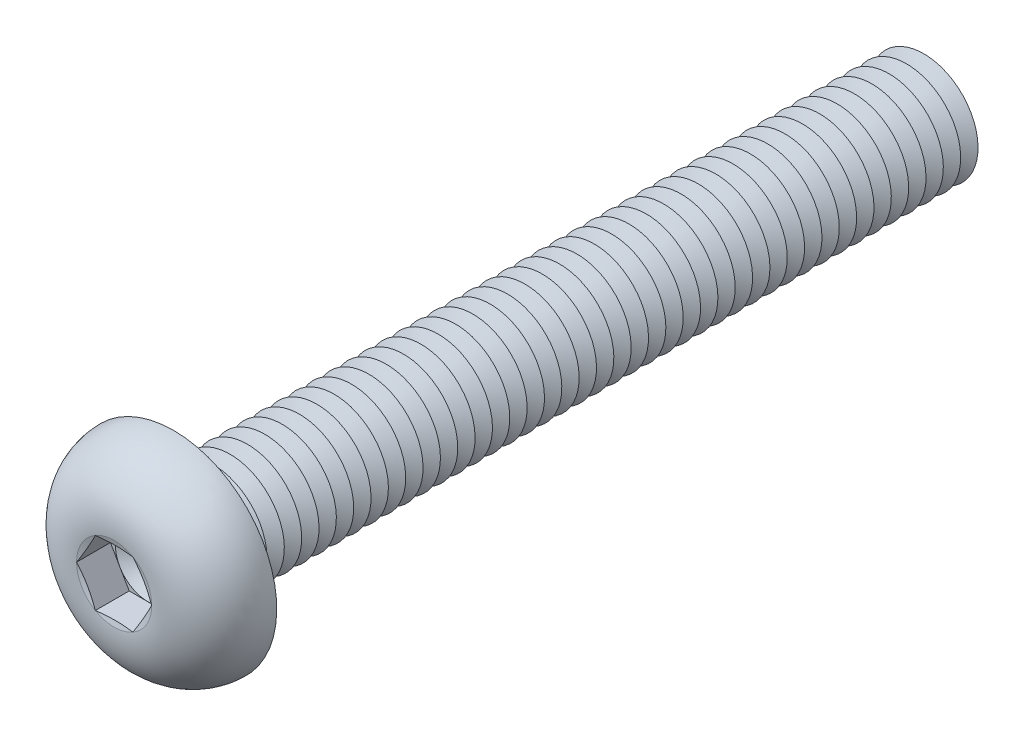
ISO-10303-21;
HEADER;
FILE_DESCRIPTION(('STEP AP214'),'2;1');
FILE_NAME('part.step','',(''),(''),'','','');
FILE_SCHEMA(('AUTOMOTIVE_DESIGN { 1 0 10303 214 1 1 1 1 }'));
ENDSEC;
DATA;
#1=APPLICATION_CONTEXT('core data for automotive mechanical design processes');
#2=APPLICATION_PROTOCOL_DEFINITION('international standard','automotive_design',2000,#1);
#3=PRODUCT_CONTEXT('',#1,'mechanical');
#4=PRODUCT('Part','Part','',(#3));
#5=PRODUCT_RELATED_PRODUCT_CATEGORY('part','',(#4));
#6=PRODUCT_DEFINITION_FORMATION('','',#4);
#7=PRODUCT_DEFINITION_CONTEXT('part definition',#1,'design');
#8=PRODUCT_DEFINITION('design','',#6,#7);
#9=PRODUCT_DEFINITION_SHAPE('','',#8);
#10=(LENGTH_UNIT() NAMED_UNIT(*) SI_UNIT(.MILLI.,.METRE.));
#11=(NAMED_UNIT(*) PLANE_ANGLE_UNIT() SI_UNIT($,.RADIAN.));
#12=(NAMED_UNIT(*) SI_UNIT($,.STERADIAN.) SOLID_ANGLE_UNIT());
#13=UNCERTAINTY_MEASURE_WITH_UNIT(LENGTH_MEASURE(1.E-05),#10,'distance_accuracy_value','');
#14=(GEOMETRIC_REPRESENTATION_CONTEXT(3) GLOBAL_UNCERTAINTY_ASSIGNED_CONTEXT((#13)) GLOBAL_UNIT_ASSIGNED_CONTEXT((#10,
#11,#12)) REPRESENTATION_CONTEXT('',''));
#15=CARTESIAN_POINT('',(0.,0.,0.));
#16=DIRECTION('',(0.,0.,1.));
#17=DIRECTION('',(1.,0.,0.));
#18=AXIS2_PLACEMENT_3D('',#15,#16,#17);
#19=CARTESIAN_POINT('',(0.,0.,1.19));
#20=DIRECTION('',(0.,0.,1.));
#21=DIRECTION('',(1.,0.,0.));
#22=AXIS2_PLACEMENT_3D('',#19,#20,#21);
#23=PLANE('',#22);
#24=CARTESIAN_POINT('',(0.,0.,1.19));
#25=DIRECTION('',(0.,0.,1.));
#26=DIRECTION('',(1.,0.,0.));
#27=AXIS2_PLACEMENT_3D('',#24,#25,#26);
#28=CIRCLE('',#27,1.49999930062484);
#29=CARTESIAN_POINT('',(1.2990375,0.749999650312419,1.19));
#30=VERTEX_POINT('',#29);
#31=CARTESIAN_POINT('',(0.,1.49999930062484,1.19));
#32=VERTEX_POINT('',#31);
#33=EDGE_CURVE('E118',#30,#32,#28,.T.);
#34=ORIENTED_EDGE('',*,*,#33,.F.);
#35=DIRECTION('',(-0.5,0.866025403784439,0.));
#36=VECTOR('',#35,1.);
#37=CARTESIAN_POINT('',(1.73205,0.,1.19));
#38=LINE('',#37,#36);
#39=CARTESIAN_POINT('',(0.866025,1.49999930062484,1.19));
#40=VERTEX_POINT('',#39);
#41=EDGE_CURVE('E125',#30,#40,#38,.T.);
#42=ORIENTED_EDGE('',*,*,#41,.T.);
#43=DIRECTION('',(-1.,0.,0.));
#44=VECTOR('',#43,1.);
#45=CARTESIAN_POINT('',(0.866025,1.49999930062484,1.19));
#46=LINE('',#45,#44);
#47=EDGE_CURVE('E136',#40,#32,#46,.T.);
#48=ORIENTED_EDGE('',*,*,#47,.T.);
#49=EDGE_LOOP('',(#34,#42,#48));
#50=FACE_BOUND('',#49,.T.);
#51=ADVANCED_FACE('F39',(#50),#23,.T.);
#52=CARTESIAN_POINT('',(0.,0.,1.19));
#53=DIRECTION('',(0.,0.,1.));
#54=DIRECTION('',(1.,0.,0.));
#55=AXIS2_PLACEMENT_3D('',#52,#53,#54);
#56=CIRCLE('',#55,1.49999930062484);
#57=CARTESIAN_POINT('',(-1.2990375,0.749999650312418,1.19));
#58=VERTEX_POINT('',#57);
#59=EDGE_CURVE('E11',#32,#58,#56,.T.);
#60=ORIENTED_EDGE('',*,*,#59,.F.);
#61=CARTESIAN_POINT('',(-0.866025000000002,1.49999930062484,1.19));
#62=VERTEX_POINT('',#61);
#63=EDGE_CURVE('E131',#32,#62,#46,.T.);
#64=ORIENTED_EDGE('',*,*,#63,.T.);
#65=DIRECTION('',(-0.5,-0.866025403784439,0.));
#66=VECTOR('',#65,1.);
#67=CARTESIAN_POINT('',(-0.866025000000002,1.49999930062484,1.19));
#68=LINE('',#67,#66);
#69=EDGE_CURVE('E134',#62,#58,#68,.T.);
#70=ORIENTED_EDGE('',*,*,#69,.T.);
#71=EDGE_LOOP('',(#60,#64,#70));
#72=FACE_BOUND('',#71,.T.);
#73=ADVANCED_FACE('F130',(#72),#23,.T.);
#74=CARTESIAN_POINT('',(-1.2990375,-0.749999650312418,1.19));
#75=VERTEX_POINT('',#74);
#76=EDGE_CURVE('E49',#58,#75,#56,.T.);
#77=ORIENTED_EDGE('',*,*,#76,.F.);
#78=CARTESIAN_POINT('',(-1.73205,0.,1.19));
#79=VERTEX_POINT('',#78);
#80=EDGE_CURVE('E143',#58,#79,#68,.T.);
#81=ORIENTED_EDGE('',*,*,#80,.T.);
#82=DIRECTION('',(0.5,-0.866025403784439,0.));
#83=VECTOR('',#82,1.);
#84=CARTESIAN_POINT('',(-1.73205,0.,1.19));
#85=LINE('',#84,#83);
#86=EDGE_CURVE('E152',#79,#75,#85,.T.);
#87=ORIENTED_EDGE('',*,*,#86,.T.);
#88=EDGE_LOOP('',(#77,#81,#87));
#89=FACE_BOUND('',#88,.T.);
#90=ADVANCED_FACE('F617',(#89),#23,.T.);
#91=CARTESIAN_POINT('',(0.,-1.49999930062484,1.19));
#92=VERTEX_POINT('',#91);
#93=EDGE_CURVE('E601',#75,#92,#56,.T.);
#94=ORIENTED_EDGE('',*,*,#93,.F.);
#95=CARTESIAN_POINT('',(-0.866025,-1.49999930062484,1.19));
#96=VERTEX_POINT('',#95);
#97=EDGE_CURVE('E151',#75,#96,#85,.T.);
#98=ORIENTED_EDGE('',*,*,#97,.T.);
#99=DIRECTION('',(1.,0.,0.));
#100=VECTOR('',#99,1.);
#101=CARTESIAN_POINT('',(-0.866025,-1.49999930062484,1.19));
#102=LINE('',#101,#100);
#103=EDGE_CURVE('E157',#96,#92,#102,.T.);
#104=ORIENTED_EDGE('',*,*,#103,.T.);
#105=EDGE_LOOP('',(#94,#98,#104));
#106=FACE_BOUND('',#105,.T.);
#107=ADVANCED_FACE('F610',(#106),#23,.T.);
#108=CARTESIAN_POINT('',(1.2990375,-0.749999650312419,1.19));
#109=VERTEX_POINT('',#108);
#110=EDGE_CURVE('E56',#92,#109,#56,.T.);
#111=ORIENTED_EDGE('',*,*,#110,.F.);
#112=CARTESIAN_POINT('',(0.866025,-1.49999930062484,1.19));
#113=VERTEX_POINT('',#112);
#114=EDGE_CURVE('E156',#92,#113,#102,.T.);
#115=ORIENTED_EDGE('',*,*,#114,.T.);
#116=DIRECTION('',(0.5,0.866025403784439,0.));
#117=VECTOR('',#116,1.);
#118=CARTESIAN_POINT('',(0.866025,-1.49999930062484,1.19));
#119=LINE('',#118,#117);
#120=EDGE_CURVE('E162',#113,#109,#119,.T.);
#121=ORIENTED_EDGE('',*,*,#120,.T.);
#122=EDGE_LOOP('',(#111,#115,#121));
#123=FACE_BOUND('',#122,.T.);
#124=ADVANCED_FACE('F686',(#123),#23,.T.);
#125=CARTESIAN_POINT('',(0.,0.,2.75));
#126=DIRECTION('',(0.,0.,1.));
#127=DIRECTION('',(0.,-1.,0.));
#128=AXIS2_PLACEMENT_3D('',#125,#126,#127);
#129=CONICAL_SURFACE('',#128,1.73205,1.30899693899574);
#130=CARTESIAN_POINT('',(1.73216547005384,-0.000200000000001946,2.75003094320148));
#131=CARTESIAN_POINT('',(1.69619207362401,0.0621077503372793,2.74038633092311));
#132=CARTESIAN_POINT('',(1.66015343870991,0.124528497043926,2.73163050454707));
#133=CARTESIAN_POINT('',(1.58794885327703,0.249590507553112,2.71624720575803));
#134=CARTESIAN_POINT('',(1.5517828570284,0.312231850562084,2.7096205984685));
#135=CARTESIAN_POINT('',(1.47954289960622,0.437355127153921,2.69888271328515));
#136=CARTESIAN_POINT('',(1.4434694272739,0.499836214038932,2.69475862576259));
#137=CARTESIAN_POINT('',(1.37127646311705,0.624878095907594,2.68922863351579));
#138=CARTESIAN_POINT('',(1.33515698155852,0.687438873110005,2.68782220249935));
#139=CARTESIAN_POINT('',(1.26291801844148,0.812560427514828,2.68782220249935));
#140=CARTESIAN_POINT('',(1.22679853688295,0.875121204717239,2.68922863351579));
#141=CARTESIAN_POINT('',(1.1546055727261,1.0001630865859,2.69475862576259));
#142=CARTESIAN_POINT('',(1.11853210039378,1.06264417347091,2.69888271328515));
#143=CARTESIAN_POINT('',(1.0462921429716,1.18776745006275,2.7096205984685));
#144=CARTESIAN_POINT('',(1.01012614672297,1.25040879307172,2.71624720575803));
#145=CARTESIAN_POINT('',(0.937921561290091,1.37547080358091,2.73163050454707));
#146=CARTESIAN_POINT('',(0.901882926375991,1.43789155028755,2.74038633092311));
#147=CARTESIAN_POINT('',(0.865909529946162,1.50019930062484,2.75003094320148));
#148=B_SPLINE_CURVE_WITH_KNOTS('',3,(#130,#131,#132,#133,#134,#135,#136,#137,#138,#139,#140,
#141,#142,#143,#144,#145,#146,#147),.UNSPECIFIED.,.F.,.F.,(4,2,2,2,2,2,2,2,4),(0.,
0.217782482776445,0.435653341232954,0.652399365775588,0.869103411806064,1.08580745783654,
1.30255348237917,1.52042434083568,1.73820682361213),.UNSPECIFIED.);
#149=CARTESIAN_POINT('',(1.73205,0.,2.75));
#150=VERTEX_POINT('',#149);
#151=CARTESIAN_POINT('',(0.866025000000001,1.49999930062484,2.75));
#152=VERTEX_POINT('',#151);
#153=EDGE_CURVE('E222',#150,#152,#148,.T.);
#154=ORIENTED_EDGE('',*,*,#153,.F.);
#155=CARTESIAN_POINT('',(0.,0.,2.75));
#156=DIRECTION('',(0.,0.,-1.));
#157=DIRECTION('',(0.,1.,0.));
#158=AXIS2_PLACEMENT_3D('',#155,#156,#157);
#159=CIRCLE('',#158,1.73205);
#160=EDGE_CURVE('E581',#152,#150,#159,.T.);
#161=ORIENTED_EDGE('',*,*,#160,.F.);
#162=EDGE_LOOP('',(#154,#161));
#163=FACE_BOUND('',#162,.T.);
#164=ADVANCED_FACE('F690',(#163),#129,.F.);
#165=CARTESIAN_POINT('',(0.865909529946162,-1.50019930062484,2.75003094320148));
#166=CARTESIAN_POINT('',(0.901882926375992,-1.43789155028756,2.74038633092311));
#167=CARTESIAN_POINT('',(0.937921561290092,-1.37547080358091,2.73163050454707));
#168=CARTESIAN_POINT('',(1.01012614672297,-1.25040879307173,2.71624720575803));
#169=CARTESIAN_POINT('',(1.0462921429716,-1.18776745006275,2.7096205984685));
#170=CARTESIAN_POINT('',(1.11853210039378,-1.06264417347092,2.69888271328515));
#171=CARTESIAN_POINT('',(1.1546055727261,-1.00016308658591,2.69475862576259));
#172=CARTESIAN_POINT('',(1.22679853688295,-0.875121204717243,2.68922863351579));
#173=CARTESIAN_POINT('',(1.26291801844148,-0.812560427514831,2.68782220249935));
#174=CARTESIAN_POINT('',(1.33515698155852,-0.687438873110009,2.68782220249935));
#175=CARTESIAN_POINT('',(1.37127646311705,-0.624878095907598,2.68922863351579));
#176=CARTESIAN_POINT('',(1.4434694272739,-0.499836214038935,2.69475862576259));
#177=CARTESIAN_POINT('',(1.47954289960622,-0.437355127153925,2.69888271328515));
#178=CARTESIAN_POINT('',(1.5517828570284,-0.312231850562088,2.7096205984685));
#179=CARTESIAN_POINT('',(1.58794885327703,-0.249590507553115,2.71624720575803));
#180=CARTESIAN_POINT('',(1.66015343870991,-0.12452849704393,2.73163050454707));
#181=CARTESIAN_POINT('',(1.69619207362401,-0.0621077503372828,2.74038633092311));
#182=CARTESIAN_POINT('',(1.73216547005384,0.000199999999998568,2.75003094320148));
#183=B_SPLINE_CURVE_WITH_KNOTS('',3,(#165,#166,#167,#168,#169,#170,#171,#172,#173,#174,#175,
#176,#177,#178,#179,#180,#181,#182),.UNSPECIFIED.,.F.,.F.,(4,2,2,2,2,2,2,2,4),(0.,
0.217782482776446,0.435653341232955,0.652399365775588,0.869103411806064,1.08580745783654,
1.30255348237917,1.52042434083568,1.73820682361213),.UNSPECIFIED.);
#184=CARTESIAN_POINT('',(0.866025,-1.49999930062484,2.75));
#185=VERTEX_POINT('',#184);
#186=EDGE_CURVE('E231',#185,#150,#183,.T.);
#187=ORIENTED_EDGE('',*,*,#186,.F.);
#188=EDGE_CURVE('E586',#150,#185,#159,.T.);
#189=ORIENTED_EDGE('',*,*,#188,.F.);
#190=EDGE_LOOP('',(#187,#189));
#191=FACE_BOUND('',#190,.T.);
#192=ADVANCED_FACE('F651',(#191),#129,.F.);
#193=CARTESIAN_POINT('',(-2.61375031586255,-1.49999930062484,3.09338600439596));
#194=CARTESIAN_POINT('',(-2.48719895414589,-1.49999930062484,3.06401688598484));
#195=CARTESIAN_POINT('',(-2.36054180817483,-1.49999930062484,3.03507426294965));
#196=CARTESIAN_POINT('',(-2.10688190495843,-1.49999930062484,2.97862489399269));
#197=CARTESIAN_POINT('',(-1.97987908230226,-1.49999930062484,2.95111844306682));
#198=CARTESIAN_POINT('',(-1.72425281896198,-1.49999930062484,2.89788845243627));
#199=CARTESIAN_POINT('',(-1.59562534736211,-1.49999930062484,2.87218404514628));
#200=CARTESIAN_POINT('',(-1.33776732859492,-1.49999930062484,2.82387586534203));
#201=CARTESIAN_POINT('',(-1.20853672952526,-1.49999930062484,2.80127236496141));
#202=CARTESIAN_POINT('',(-0.952831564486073,-1.49999930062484,2.76126658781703));
#203=CARTESIAN_POINT('',(-0.826376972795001,-1.49999930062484,2.74374018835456));
#204=CARTESIAN_POINT('',(-0.572755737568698,-1.49999930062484,2.71502809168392));
#205=CARTESIAN_POINT('',(-0.44558933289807,-1.49999930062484,2.70384038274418));
#206=CARTESIAN_POINT('',(-0.191333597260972,-1.49999930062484,2.68972083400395));
#207=CARTESIAN_POINT('',(-0.0642464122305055,-1.49999930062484,2.68675270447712));
#208=CARTESIAN_POINT('',(0.189835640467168,-1.49999930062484,2.68959577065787));
#209=CARTESIAN_POINT('',(0.316830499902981,-1.49999930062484,2.69540767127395));
#210=CARTESIAN_POINT('',(0.534182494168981,-1.49999930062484,2.71190493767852));
#211=CARTESIAN_POINT('',(0.624691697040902,-1.49999930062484,2.72073513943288));
#212=CARTESIAN_POINT('',(0.805336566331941,-1.49999930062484,2.74156379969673));
#213=CARTESIAN_POINT('',(0.895472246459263,-1.49999930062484,2.75356214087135));
#214=CARTESIAN_POINT('',(1.0756572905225,-1.49999930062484,2.78006977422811));
#215=CARTESIAN_POINT('',(1.16570548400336,-1.49999930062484,2.7945868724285));
#216=CARTESIAN_POINT('',(1.3454787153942,-1.49999930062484,2.82550612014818));
#217=CARTESIAN_POINT('',(1.43520373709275,-1.49999930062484,2.8419083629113));
#218=CARTESIAN_POINT('',(1.61622412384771,-1.49999930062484,2.87648604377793));
#219=CARTESIAN_POINT('',(1.70751379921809,-1.49999930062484,2.89469103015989));
#220=CARTESIAN_POINT('',(1.88986344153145,-1.49999930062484,2.93221618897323));
#221=CARTESIAN_POINT('',(1.98092340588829,-1.49999930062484,2.95153637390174));
#222=CARTESIAN_POINT('',(2.16236354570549,-1.49999930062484,2.99091506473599));
#223=CARTESIAN_POINT('',(2.25274472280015,-1.49999930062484,3.01096897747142));
#224=CARTESIAN_POINT('',(2.43335289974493,-1.49999930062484,3.05173139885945));
#225=CARTESIAN_POINT('',(2.52357990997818,-1.49999930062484,3.07243986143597));
#226=CARTESIAN_POINT('',(2.61375031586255,-1.49999930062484,3.09338600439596));
#227=B_SPLINE_CURVE_WITH_KNOTS('',3,(#193,#194,#195,#196,#197,#198,#199,#200,#201,#202,#203,
#204,#205,#206,#207,#208,#209,#210,#211,#212,#213,#214,#215,#216,#217,#218,#219,#220,#221,#222,
#223,#224,#225,#226),.UNSPECIFIED.,.F.,.F.,(4,2,2,2,2,2,2,2,2,2,2,2,2,2,2,2,4),(0.,
0.389753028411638,0.779585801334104,1.17307326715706,1.5665952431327,1.94947555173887,
2.33223427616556,2.71330039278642,3.09439710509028,3.36715350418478,3.63989980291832,
3.91350699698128,4.18712773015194,4.4663802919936,4.74563598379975,5.02337106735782,
5.3010866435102),.UNSPECIFIED.);
#228=CARTESIAN_POINT('',(-0.866025,-1.49999930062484,2.75));
#229=VERTEX_POINT('',#228);
#230=EDGE_CURVE('E631',#229,#185,#227,.T.);
#231=ORIENTED_EDGE('',*,*,#230,.F.);
#232=EDGE_CURVE('E644',#185,#229,#159,.T.);
#233=ORIENTED_EDGE('',*,*,#232,.F.);
#234=EDGE_LOOP('',(#231,#233));
#235=FACE_BOUND('',#234,.T.);
#236=ADVANCED_FACE('F657',(#235),#129,.F.);
#237=CARTESIAN_POINT('',(-1.73216547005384,0.000199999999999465,2.75003094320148));
#238=CARTESIAN_POINT('',(-1.69619207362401,-0.062107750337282,2.74038633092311));
#239=CARTESIAN_POINT('',(-1.66015343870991,-0.124528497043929,2.73163050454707));
#240=CARTESIAN_POINT('',(-1.58794885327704,-0.249590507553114,2.71624720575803));
#241=CARTESIAN_POINT('',(-1.55178285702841,-0.312231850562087,2.7096205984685));
#242=CARTESIAN_POINT('',(-1.47954289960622,-0.437355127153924,2.69888271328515));
#243=CARTESIAN_POINT('',(-1.4434694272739,-0.499836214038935,2.69475862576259));
#244=CARTESIAN_POINT('',(-1.37127646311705,-0.624878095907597,2.68922863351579));
#245=CARTESIAN_POINT('',(-1.33515698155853,-0.687438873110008,2.68782220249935));
#246=CARTESIAN_POINT('',(-1.26291801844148,-0.812560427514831,2.68782220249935));
#247=CARTESIAN_POINT('',(-1.22679853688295,-0.875121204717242,2.68922863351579));
#248=CARTESIAN_POINT('',(-1.1546055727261,-1.0001630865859,2.69475862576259));
#249=CARTESIAN_POINT('',(-1.11853210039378,-1.06264417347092,2.69888271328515));
#250=CARTESIAN_POINT('',(-1.0462921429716,-1.18776745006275,2.7096205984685));
#251=CARTESIAN_POINT('',(-1.01012614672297,-1.25040879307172,2.71624720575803));
#252=CARTESIAN_POINT('',(-0.937921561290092,-1.37547080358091,2.73163050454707));
#253=CARTESIAN_POINT('',(-0.901882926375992,-1.43789155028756,2.74038633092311));
#254=CARTESIAN_POINT('',(-0.865909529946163,-1.50019930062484,2.75003094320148));
#255=B_SPLINE_CURVE_WITH_KNOTS('',3,(#237,#238,#239,#240,#241,#242,#243,#244,#245,#246,#247,
#248,#249,#250,#251,#252,#253,#254),.UNSPECIFIED.,.F.,.F.,(4,2,2,2,2,2,2,2,4),(0.,
0.217782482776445,0.435653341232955,0.652399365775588,0.869103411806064,1.08580745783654,
1.30255348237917,1.52042434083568,1.73820682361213),.UNSPECIFIED.);
#256=CARTESIAN_POINT('',(-1.73205,0.,2.75));
#257=VERTEX_POINT('',#256);
#258=EDGE_CURVE('E622',#257,#229,#255,.T.);
#259=ORIENTED_EDGE('',*,*,#258,.F.);
#260=EDGE_CURVE('E628',#229,#257,#159,.T.);
#261=ORIENTED_EDGE('',*,*,#260,.F.);
#262=EDGE_LOOP('',(#259,#261));
#263=FACE_BOUND('',#262,.T.);
#264=ADVANCED_FACE('F626',(#263),#129,.F.);
#265=CARTESIAN_POINT('',(-0.865909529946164,1.50019930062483,2.75003094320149));
#266=CARTESIAN_POINT('',(-0.901882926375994,1.43789155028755,2.74038633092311));
#267=CARTESIAN_POINT('',(-0.937921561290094,1.37547080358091,2.73163050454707));
#268=CARTESIAN_POINT('',(-1.01012614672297,1.25040879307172,2.71624720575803));
#269=CARTESIAN_POINT('',(-1.0462921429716,1.18776745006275,2.7096205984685));
#270=CARTESIAN_POINT('',(-1.11853210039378,1.06264417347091,2.69888271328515));
#271=CARTESIAN_POINT('',(-1.1546055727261,1.0001630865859,2.69475862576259));
#272=CARTESIAN_POINT('',(-1.22679853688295,0.87512120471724,2.68922863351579));
#273=CARTESIAN_POINT('',(-1.26291801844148,0.812560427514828,2.68782220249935));
#274=CARTESIAN_POINT('',(-1.33515698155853,0.687438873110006,2.68782220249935));
#275=CARTESIAN_POINT('',(-1.37127646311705,0.624878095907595,2.68922863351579));
#276=CARTESIAN_POINT('',(-1.4434694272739,0.499836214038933,2.69475862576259));
#277=CARTESIAN_POINT('',(-1.47954289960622,0.437355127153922,2.69888271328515));
#278=CARTESIAN_POINT('',(-1.55178285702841,0.312231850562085,2.7096205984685));
#279=CARTESIAN_POINT('',(-1.58794885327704,0.249590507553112,2.71624720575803));
#280=CARTESIAN_POINT('',(-1.66015343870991,0.124528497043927,2.73163050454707));
#281=CARTESIAN_POINT('',(-1.69619207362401,0.0621077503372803,2.74038633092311));
#282=CARTESIAN_POINT('',(-1.73216547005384,-0.000200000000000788,2.75003094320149));
#283=B_SPLINE_CURVE_WITH_KNOTS('',3,(#265,#266,#267,#268,#269,#270,#271,#272,#273,#274,#275,
#276,#277,#278,#279,#280,#281,#282),.UNSPECIFIED.,.F.,.F.,(4,2,2,2,2,2,2,2,4),(0.,
0.217782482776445,0.435653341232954,0.652399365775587,0.869103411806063,1.08580745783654,
1.30255348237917,1.52042434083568,1.73820682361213),.UNSPECIFIED.);
#284=CARTESIAN_POINT('',(-0.866025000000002,1.49999930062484,2.75));
#285=VERTEX_POINT('',#284);
#286=EDGE_CURVE('E195',#285,#257,#283,.T.);
#287=ORIENTED_EDGE('',*,*,#286,.F.);
#288=EDGE_CURVE('E634',#257,#285,#159,.T.);
#289=ORIENTED_EDGE('',*,*,#288,.F.);
#290=EDGE_LOOP('',(#287,#289));
#291=FACE_BOUND('',#290,.T.);
#292=ADVANCED_FACE('F635',(#291),#129,.F.);
#293=CARTESIAN_POINT('',(0.,0.,-32.2));
#294=DIRECTION('',(0.,0.,1.));
#295=DIRECTION('',(0.,-1.,0.));
#296=AXIS2_PLACEMENT_3D('',#293,#294,#295);
#297=CONICAL_SURFACE('',#296,2.49999999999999,1.0471975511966);
#298=CARTESIAN_POINT('',(0.,0.,-32.6));
#299=DIRECTION('',(0.,0.,1.));
#300=DIRECTION('',(0.,-1.,0.));
#301=AXIS2_PLACEMENT_3D('',#298,#299,#300);
#302=CIRCLE('',#301,1.80717967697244);
#303=CARTESIAN_POINT('',(0.,-1.80717967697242,-32.6));
#304=VERTEX_POINT('',#303);
#305=EDGE_CURVE('E552',#304,#304,#302,.T.);
#306=ORIENTED_EDGE('',*,*,#305,.T.);
#307=EDGE_LOOP('',(#306));
#308=FACE_BOUND('',#307,.T.);
#309=CARTESIAN_POINT('',(0.,0.,-32.2));
#310=DIRECTION('',(0.,0.,1.));
#311=DIRECTION('',(0.,-1.,0.));
#312=AXIS2_PLACEMENT_3D('',#309,#310,#311);
#313=CIRCLE('',#312,2.49999999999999);
#314=CARTESIAN_POINT('',(0.,-2.49999999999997,-32.2));
#315=VERTEX_POINT('',#314);
#316=EDGE_CURVE('E548',#315,#315,#313,.T.);
#317=ORIENTED_EDGE('',*,*,#316,.F.);
#318=EDGE_LOOP('',(#317));
#319=FACE_BOUND('',#318,.T.);
#320=ADVANCED_FACE('F714',(#308,#319),#297,.T.);
#321=CARTESIAN_POINT('',(0.,0.,-32.6));
#322=DIRECTION('',(0.,0.,-1.));
#323=DIRECTION('',(0.,1.,0.));
#324=AXIS2_PLACEMENT_3D('',#321,#322,#323);
#325=CONICAL_SURFACE('',#324,1.80717967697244,1.0471975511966);
#326=CARTESIAN_POINT('',(0.,0.,-33.));
#327=DIRECTION('',(0.,0.,1.));
#328=DIRECTION('',(0.,-1.,0.));
#329=AXIS2_PLACEMENT_3D('',#326,#327,#328);
#330=CIRCLE('',#329,2.49999999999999);
#331=CARTESIAN_POINT('',(0.,-2.49999999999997,-33.));
#332=VERTEX_POINT('',#331);
#333=EDGE_CURVE('E556',#332,#332,#330,.T.);
#334=ORIENTED_EDGE('',*,*,#333,.T.);
#335=EDGE_LOOP('',(#334));
#336=FACE_BOUND('',#335,.T.);
#337=ORIENTED_EDGE('',*,*,#305,.F.);
#338=EDGE_LOOP('',(#337));
#339=FACE_BOUND('',#338,.T.);
#340=ADVANCED_FACE('F719',(#336,#339),#325,.T.);
#341=CARTESIAN_POINT('',(0.,2.5,-35.));
#342=DIRECTION('',(0.,0.,-1.));
#343=DIRECTION('',(0.,1.,0.));
#344=AXIS2_PLACEMENT_3D('',#341,#342,#343);
#345=PLANE('',#344);
#346=CARTESIAN_POINT('',(0.,0.,-35.));
#347=DIRECTION('',(0.,0.,1.));
#348=DIRECTION('',(0.,-1.,0.));
#349=AXIS2_PLACEMENT_3D('',#346,#347,#348);
#350=CIRCLE('',#349,1.80717967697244);
#351=CARTESIAN_POINT('',(0.,-1.80717967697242,-35.));
#352=VERTEX_POINT('',#351);
#353=EDGE_CURVE('E576',#352,#352,#350,.T.);
#354=ORIENTED_EDGE('',*,*,#353,.F.);
#355=EDGE_LOOP('',(#354));
#356=FACE_BOUND('',#355,.T.);
#357=ADVANCED_FACE('F894',(#356),#345,.T.);
#358=CARTESIAN_POINT('',(0.,0.,-34.6));
#359=DIRECTION('',(0.,0.,1.));
#360=DIRECTION('',(0.,-1.,0.));
#361=AXIS2_PLACEMENT_3D('',#358,#359,#360);
#362=CONICAL_SURFACE('',#361,2.49999999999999,1.0471975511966);
#363=ORIENTED_EDGE('',*,*,#353,.T.);
#364=EDGE_LOOP('',(#363));
#365=FACE_BOUND('',#364,.T.);
#366=CARTESIAN_POINT('',(0.,0.,-34.6));
#367=DIRECTION('',(0.,0.,1.));
#368=DIRECTION('',(0.,-1.,0.));
#369=AXIS2_PLACEMENT_3D('',#366,#367,#368);
#370=CIRCLE('',#369,2.49999999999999);
#371=CARTESIAN_POINT('',(0.,-2.49999999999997,-34.6));
#372=VERTEX_POINT('',#371);
#373=EDGE_CURVE('E572',#372,#372,#370,.T.);
#374=ORIENTED_EDGE('',*,*,#373,.F.);
#375=EDGE_LOOP('',(#374));
#376=FACE_BOUND('',#375,.T.);
#377=ADVANCED_FACE('F887',(#365,#376),#362,.T.);
#378=CARTESIAN_POINT('',(0.,0.,-34.2));
#379=DIRECTION('',(0.,0.,-1.));
#380=DIRECTION('',(0.,1.,0.));
#381=AXIS2_PLACEMENT_3D('',#378,#379,#380);
#382=CONICAL_SURFACE('',#381,1.80717967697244,1.0471975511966);
#383=ORIENTED_EDGE('',*,*,#373,.T.);
#384=EDGE_LOOP('',(#383));
#385=FACE_BOUND('',#384,.T.);
#386=CARTESIAN_POINT('',(0.,0.,-34.2));
#387=DIRECTION('',(0.,0.,1.));
#388=DIRECTION('',(0.,-1.,0.));
#389=AXIS2_PLACEMENT_3D('',#386,#387,#388);
#390=CIRCLE('',#389,1.80717967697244);
#391=CARTESIAN_POINT('',(0.,-1.80717967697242,-34.2));
#392=VERTEX_POINT('',#391);
#393=EDGE_CURVE('E568',#392,#392,#390,.T.);
#394=ORIENTED_EDGE('',*,*,#393,.F.);
#395=EDGE_LOOP('',(#394));
#396=FACE_BOUND('',#395,.T.);
#397=ADVANCED_FACE('F893',(#385,#396),#382,.T.);
#398=CARTESIAN_POINT('',(0.,0.,-33.8));
#399=DIRECTION('',(0.,0.,1.));
#400=DIRECTION('',(0.,-1.,0.));
#401=AXIS2_PLACEMENT_3D('',#398,#399,#400);
#402=CONICAL_SURFACE('',#401,2.49999999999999,1.0471975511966);
#403=ORIENTED_EDGE('',*,*,#393,.T.);
#404=EDGE_LOOP('',(#403));
#405=FACE_BOUND('',#404,.T.);
#406=CARTESIAN_POINT('',(0.,0.,-33.8));
#407=DIRECTION('',(0.,0.,1.));
#408=DIRECTION('',(0.,-1.,0.));
#409=AXIS2_PLACEMENT_3D('',#406,#407,#408);
#410=CIRCLE('',#409,2.49999999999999);
#411=CARTESIAN_POINT('',(0.,-2.49999999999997,-33.8));
#412=VERTEX_POINT('',#411);
#413=EDGE_CURVE('E564',#412,#412,#410,.T.);
#414=ORIENTED_EDGE('',*,*,#413,.F.);
#415=EDGE_LOOP('',(#414));
#416=FACE_BOUND('',#415,.T.);
#417=ADVANCED_FACE('F925',(#405,#416),#402,.T.);
#418=CARTESIAN_POINT('',(0.,0.,-33.4));
#419=DIRECTION('',(0.,0.,-1.));
#420=DIRECTION('',(0.,1.,0.));
#421=AXIS2_PLACEMENT_3D('',#418,#419,#420);
#422=CONICAL_SURFACE('',#421,1.80717967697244,1.0471975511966);
#423=ORIENTED_EDGE('',*,*,#413,.T.);
#424=EDGE_LOOP('',(#423));
#425=FACE_BOUND('',#424,.T.);
#426=CARTESIAN_POINT('',(0.,0.,-33.4));
#427=DIRECTION('',(0.,0.,1.));
#428=DIRECTION('',(0.,-1.,0.));
#429=AXIS2_PLACEMENT_3D('',#426,#427,#428);
#430=CIRCLE('',#429,1.80717967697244);
#431=CARTESIAN_POINT('',(0.,-1.80717967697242,-33.4));
#432=VERTEX_POINT('',#431);
#433=EDGE_CURVE('E560',#432,#432,#430,.T.);
#434=ORIENTED_EDGE('',*,*,#433,.F.);
#435=EDGE_LOOP('',(#434));
#436=FACE_BOUND('',#435,.T.);
#437=ADVANCED_FACE('F935',(#425,#436),#422,.T.);
#438=CARTESIAN_POINT('',(0.,0.,-33.));
#439=DIRECTION('',(0.,0.,1.));
#440=DIRECTION('',(0.,-1.,0.));
#441=AXIS2_PLACEMENT_3D('',#438,#439,#440);
#442=CONICAL_SURFACE('',#441,2.49999999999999,1.0471975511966);
#443=ORIENTED_EDGE('',*,*,#433,.T.);
#444=EDGE_LOOP('',(#443));
#445=FACE_BOUND('',#444,.T.);
#446=ORIENTED_EDGE('',*,*,#333,.F.);
#447=EDGE_LOOP('',(#446));
#448=FACE_BOUND('',#447,.T.);
#449=ADVANCED_FACE('F945',(#445,#448),#442,.T.);
#450=CARTESIAN_POINT('',(0.,0.,-31.4));
#451=DIRECTION('',(0.,0.,1.));
#452=DIRECTION('',(0.,-1.,0.));
#453=AXIS2_PLACEMENT_3D('',#450,#451,#452);
#454=CONICAL_SURFACE('',#453,2.49999999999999,1.0471975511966);
#455=CARTESIAN_POINT('',(0.,0.,-31.8));
#456=DIRECTION('',(0.,0.,1.));
#457=DIRECTION('',(0.,-1.,0.));
#458=AXIS2_PLACEMENT_3D('',#455,#456,#457);
#459=CIRCLE('',#458,1.80717967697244);
#460=CARTESIAN_POINT('',(0.,-1.80717967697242,-31.8));
#461=VERTEX_POINT('',#460);
#462=EDGE_CURVE('E544',#461,#461,#459,.T.);
#463=ORIENTED_EDGE('',*,*,#462,.T.);
#464=EDGE_LOOP('',(#463));
#465=FACE_BOUND('',#464,.T.);
#466=CARTESIAN_POINT('',(0.,0.,-31.4));
#467=DIRECTION('',(0.,0.,1.));
#468=DIRECTION('',(0.,-1.,0.));
#469=AXIS2_PLACEMENT_3D('',#466,#467,#468);
#470=CIRCLE('',#469,2.49999999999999);
#471=CARTESIAN_POINT('',(0.,-2.49999999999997,-31.4));
#472=VERTEX_POINT('',#471);
#473=EDGE_CURVE('E540',#472,#472,#470,.T.);
#474=ORIENTED_EDGE('',*,*,#473,.F.);
#475=EDGE_LOOP('',(#474));
#476=FACE_BOUND('',#475,.T.);
#477=ADVANCED_FACE('F955',(#465,#476),#454,.T.);
#478=CARTESIAN_POINT('',(0.,0.,-31.8));
#479=DIRECTION('',(0.,0.,-1.));
#480=DIRECTION('',(0.,1.,0.));
#481=AXIS2_PLACEMENT_3D('',#478,#479,#480);
#482=CONICAL_SURFACE('',#481,1.80717967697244,1.0471975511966);
#483=ORIENTED_EDGE('',*,*,#316,.T.);
#484=EDGE_LOOP('',(#483));
#485=FACE_BOUND('',#484,.T.);
#486=ORIENTED_EDGE('',*,*,#462,.F.);
#487=EDGE_LOOP('',(#486));
#488=FACE_BOUND('',#487,.T.);
#489=ADVANCED_FACE('F965',(#485,#488),#482,.T.);
#490=CARTESIAN_POINT('',(0.,0.,-30.6));
#491=DIRECTION('',(0.,0.,1.));
#492=DIRECTION('',(0.,-1.,0.));
#493=AXIS2_PLACEMENT_3D('',#490,#491,#492);
#494=CONICAL_SURFACE('',#493,2.49999999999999,1.0471975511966);
#495=CARTESIAN_POINT('',(0.,0.,-31.));
#496=DIRECTION('',(0.,0.,1.));
#497=DIRECTION('',(0.,-1.,0.));
#498=AXIS2_PLACEMENT_3D('',#495,#496,#497);
#499=CIRCLE('',#498,1.80717967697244);
#500=CARTESIAN_POINT('',(0.,-1.80717967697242,-31.));
#501=VERTEX_POINT('',#500);
#502=EDGE_CURVE('E536',#501,#501,#499,.T.);
#503=ORIENTED_EDGE('',*,*,#502,.T.);
#504=EDGE_LOOP('',(#503));
#505=FACE_BOUND('',#504,.T.);
#506=CARTESIAN_POINT('',(0.,0.,-30.6));
#507=DIRECTION('',(0.,0.,1.));
#508=DIRECTION('',(0.,-1.,0.));
#509=AXIS2_PLACEMENT_3D('',#506,#507,#508);
#510=CIRCLE('',#509,2.49999999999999);
#511=CARTESIAN_POINT('',(0.,-2.49999999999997,-30.6));
#512=VERTEX_POINT('',#511);
#513=EDGE_CURVE('E532',#512,#512,#510,.T.);
#514=ORIENTED_EDGE('',*,*,#513,.F.);
#515=EDGE_LOOP('',(#514));
#516=FACE_BOUND('',#515,.T.);
#517=ADVANCED_FACE('F975',(#505,#516),#494,.T.);
#518=CARTESIAN_POINT('',(0.,0.,-31.));
#519=DIRECTION('',(0.,0.,-1.));
#520=DIRECTION('',(0.,1.,0.));
#521=AXIS2_PLACEMENT_3D('',#518,#519,#520);
#522=CONICAL_SURFACE('',#521,1.80717967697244,1.0471975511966);
#523=ORIENTED_EDGE('',*,*,#473,.T.);
#524=EDGE_LOOP('',(#523));
#525=FACE_BOUND('',#524,.T.);
#526=ORIENTED_EDGE('',*,*,#502,.F.);
#527=EDGE_LOOP('',(#526));
#528=FACE_BOUND('',#527,.T.);
#529=ADVANCED_FACE('F985',(#525,#528),#522,.T.);
#530=CARTESIAN_POINT('',(0.,0.,-29.8));
#531=DIRECTION('',(0.,0.,1.));
#532=DIRECTION('',(0.,-1.,0.));
#533=AXIS2_PLACEMENT_3D('',#530,#531,#532);
#534=CONICAL_SURFACE('',#533,2.49999999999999,1.0471975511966);
#535=CARTESIAN_POINT('',(0.,0.,-30.2));
#536=DIRECTION('',(0.,0.,1.));
#537=DIRECTION('',(0.,-1.,0.));
#538=AXIS2_PLACEMENT_3D('',#535,#536,#537);
#539=CIRCLE('',#538,1.80717967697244);
#540=CARTESIAN_POINT('',(0.,-1.80717967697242,-30.2));
#541=VERTEX_POINT('',#540);
#542=EDGE_CURVE('E528',#541,#541,#539,.T.);
#543=ORIENTED_EDGE('',*,*,#542,.T.);
#544=EDGE_LOOP('',(#543));
#545=FACE_BOUND('',#544,.T.);
#546=CARTESIAN_POINT('',(0.,0.,-29.8));
#547=DIRECTION('',(0.,0.,1.));
#548=DIRECTION('',(0.,-1.,0.));
#549=AXIS2_PLACEMENT_3D('',#546,#547,#548);
#550=CIRCLE('',#549,2.49999999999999);
#551=CARTESIAN_POINT('',(0.,-2.49999999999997,-29.8));
#552=VERTEX_POINT('',#551);
#553=EDGE_CURVE('E524',#552,#552,#550,.T.);
#554=ORIENTED_EDGE('',*,*,#553,.F.);
#555=EDGE_LOOP('',(#554));
#556=FACE_BOUND('',#555,.T.);
#557=ADVANCED_FACE('F995',(#545,#556),#534,.T.);
#558=CARTESIAN_POINT('',(0.,0.,-30.2));
#559=DIRECTION('',(0.,0.,-1.));
#560=DIRECTION('',(0.,1.,0.));
#561=AXIS2_PLACEMENT_3D('',#558,#559,#560);
#562=CONICAL_SURFACE('',#561,1.80717967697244,1.0471975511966);
#563=ORIENTED_EDGE('',*,*,#513,.T.);
#564=EDGE_LOOP('',(#563));
#565=FACE_BOUND('',#564,.T.);
#566=ORIENTED_EDGE('',*,*,#542,.F.);
#567=EDGE_LOOP('',(#566));
#568=FACE_BOUND('',#567,.T.);
#569=ADVANCED_FACE('F1005',(#565,#568),#562,.T.);
#570=CARTESIAN_POINT('',(0.,0.,-29.));
#571=DIRECTION('',(0.,0.,1.));
#572=DIRECTION('',(0.,-1.,0.));
#573=AXIS2_PLACEMENT_3D('',#570,#571,#572);
#574=CONICAL_SURFACE('',#573,2.49999999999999,1.0471975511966);
#575=CARTESIAN_POINT('',(0.,0.,-29.4));
#576=DIRECTION('',(0.,0.,1.));
#577=DIRECTION('',(0.,-1.,0.));
#578=AXIS2_PLACEMENT_3D('',#575,#576,#577);
#579=CIRCLE('',#578,1.80717967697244);
#580=CARTESIAN_POINT('',(0.,-1.80717967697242,-29.4));
#581=VERTEX_POINT('',#580);
#582=EDGE_CURVE('E520',#581,#581,#579,.T.);
#583=ORIENTED_EDGE('',*,*,#582,.T.);
#584=EDGE_LOOP('',(#583));
#585=FACE_BOUND('',#584,.T.);
#586=CARTESIAN_POINT('',(0.,0.,-29.));
#587=DIRECTION('',(0.,0.,1.));
#588=DIRECTION('',(0.,-1.,0.));
#589=AXIS2_PLACEMENT_3D('',#586,#587,#588);
#590=CIRCLE('',#589,2.49999999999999);
#591=CARTESIAN_POINT('',(0.,-2.49999999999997,-29.));
#592=VERTEX_POINT('',#591);
#593=EDGE_CURVE('E516',#592,#592,#590,.T.);
#594=ORIENTED_EDGE('',*,*,#593,.F.);
#595=EDGE_LOOP('',(#594));
#596=FACE_BOUND('',#595,.T.);
#597=ADVANCED_FACE('F1015',(#585,#596),#574,.T.);
#598=CARTESIAN_POINT('',(0.,0.,-29.4));
#599=DIRECTION('',(0.,0.,-1.));
#600=DIRECTION('',(0.,1.,0.));
#601=AXIS2_PLACEMENT_3D('',#598,#599,#600);
#602=CONICAL_SURFACE('',#601,1.80717967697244,1.0471975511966);
#603=ORIENTED_EDGE('',*,*,#553,.T.);
#604=EDGE_LOOP('',(#603));
#605=FACE_BOUND('',#604,.T.);
#606=ORIENTED_EDGE('',*,*,#582,.F.);
#607=EDGE_LOOP('',(#606));
#608=FACE_BOUND('',#607,.T.);
#609=ADVANCED_FACE('F1025',(#605,#608),#602,.T.);
#610=CARTESIAN_POINT('',(0.,0.,-28.2));
#611=DIRECTION('',(0.,0.,1.));
#612=DIRECTION('',(0.,-1.,0.));
#613=AXIS2_PLACEMENT_3D('',#610,#611,#612);
#614=CONICAL_SURFACE('',#613,2.49999999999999,1.0471975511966);
#615=CARTESIAN_POINT('',(0.,0.,-28.6));
#616=DIRECTION('',(0.,0.,1.));
#617=DIRECTION('',(0.,-1.,0.));
#618=AXIS2_PLACEMENT_3D('',#615,#616,#617);
#619=CIRCLE('',#618,1.80717967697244);
#620=CARTESIAN_POINT('',(0.,-1.80717967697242,-28.6));
#621=VERTEX_POINT('',#620);
#622=EDGE_CURVE('E512',#621,#621,#619,.T.);
#623=ORIENTED_EDGE('',*,*,#622,.T.);
#624=EDGE_LOOP('',(#623));
#625=FACE_BOUND('',#624,.T.);
#626=CARTESIAN_POINT('',(0.,0.,-28.2));
#627=DIRECTION('',(0.,0.,1.));
#628=DIRECTION('',(0.,-1.,0.));
#629=AXIS2_PLACEMENT_3D('',#626,#627,#628);
#630=CIRCLE('',#629,2.49999999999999);
#631=CARTESIAN_POINT('',(0.,-2.49999999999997,-28.2));
#632=VERTEX_POINT('',#631);
#633=EDGE_CURVE('E508',#632,#632,#630,.T.);
#634=ORIENTED_EDGE('',*,*,#633,.F.);
#635=EDGE_LOOP('',(#634));
#636=FACE_BOUND('',#635,.T.);
#637=ADVANCED_FACE('F1035',(#625,#636),#614,.T.);
#638=CARTESIAN_POINT('',(0.,0.,-28.6));
#639=DIRECTION('',(0.,0.,-1.));
#640=DIRECTION('',(0.,1.,0.));
#641=AXIS2_PLACEMENT_3D('',#638,#639,#640);
#642=CONICAL_SURFACE('',#641,1.80717967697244,1.0471975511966);
#643=ORIENTED_EDGE('',*,*,#593,.T.);
#644=EDGE_LOOP('',(#643));
#645=FACE_BOUND('',#644,.T.);
#646=ORIENTED_EDGE('',*,*,#622,.F.);
#647=EDGE_LOOP('',(#646));
#648=FACE_BOUND('',#647,.T.);
#649=ADVANCED_FACE('F1045',(#645,#648),#642,.T.);
#650=CARTESIAN_POINT('',(0.,0.,-27.4));
#651=DIRECTION('',(0.,0.,1.));
#652=DIRECTION('',(0.,-1.,0.));
#653=AXIS2_PLACEMENT_3D('',#650,#651,#652);
#654=CONICAL_SURFACE('',#653,2.49999999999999,1.0471975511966);
#655=CARTESIAN_POINT('',(0.,0.,-27.8));
#656=DIRECTION('',(0.,0.,1.));
#657=DIRECTION('',(0.,-1.,0.));
#658=AXIS2_PLACEMENT_3D('',#655,#656,#657);
#659=CIRCLE('',#658,1.80717967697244);
#660=CARTESIAN_POINT('',(0.,-1.80717967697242,-27.8));
#661=VERTEX_POINT('',#660);
#662=EDGE_CURVE('E504',#661,#661,#659,.T.);
#663=ORIENTED_EDGE('',*,*,#662,.T.);
#664=EDGE_LOOP('',(#663));
#665=FACE_BOUND('',#664,.T.);
#666=CARTESIAN_POINT('',(0.,0.,-27.4));
#667=DIRECTION('',(0.,0.,1.));
#668=DIRECTION('',(0.,-1.,0.));
#669=AXIS2_PLACEMENT_3D('',#666,#667,#668);
#670=CIRCLE('',#669,2.49999999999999);
#671=CARTESIAN_POINT('',(0.,-2.49999999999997,-27.4));
#672=VERTEX_POINT('',#671);
#673=EDGE_CURVE('E500',#672,#672,#670,.T.);
#674=ORIENTED_EDGE('',*,*,#673,.F.);
#675=EDGE_LOOP('',(#674));
#676=FACE_BOUND('',#675,.T.);
#677=ADVANCED_FACE('F1055',(#665,#676),#654,.T.);
#678=CARTESIAN_POINT('',(0.,0.,-27.8));
#679=DIRECTION('',(0.,0.,-1.));
#680=DIRECTION('',(0.,1.,0.));
#681=AXIS2_PLACEMENT_3D('',#678,#679,#680);
#682=CONICAL_SURFACE('',#681,1.80717967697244,1.0471975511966);
#683=ORIENTED_EDGE('',*,*,#633,.T.);
#684=EDGE_LOOP('',(#683));
#685=FACE_BOUND('',#684,.T.);
#686=ORIENTED_EDGE('',*,*,#662,.F.);
#687=EDGE_LOOP('',(#686));
#688=FACE_BOUND('',#687,.T.);
#689=ADVANCED_FACE('F1065',(#685,#688),#682,.T.);
#690=CARTESIAN_POINT('',(0.,0.,-26.6));
#691=DIRECTION('',(0.,0.,1.));
#692=DIRECTION('',(0.,-1.,0.));
#693=AXIS2_PLACEMENT_3D('',#690,#691,#692);
#694=CONICAL_SURFACE('',#693,2.49999999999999,1.0471975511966);
#695=CARTESIAN_POINT('',(0.,0.,-27.));
#696=DIRECTION('',(0.,0.,1.));
#697=DIRECTION('',(0.,-1.,0.));
#698=AXIS2_PLACEMENT_3D('',#695,#696,#697);
#699=CIRCLE('',#698,1.80717967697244);
#700=CARTESIAN_POINT('',(0.,-1.80717967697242,-27.));
#701=VERTEX_POINT('',#700);
#702=EDGE_CURVE('E496',#701,#701,#699,.T.);
#703=ORIENTED_EDGE('',*,*,#702,.T.);
#704=EDGE_LOOP('',(#703));
#705=FACE_BOUND('',#704,.T.);
#706=CARTESIAN_POINT('',(0.,0.,-26.6));
#707=DIRECTION('',(0.,0.,1.));
#708=DIRECTION('',(0.,-1.,0.));
#709=AXIS2_PLACEMENT_3D('',#706,#707,#708);
#710=CIRCLE('',#709,2.49999999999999);
#711=CARTESIAN_POINT('',(0.,-2.49999999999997,-26.6));
#712=VERTEX_POINT('',#711);
#713=EDGE_CURVE('E492',#712,#712,#710,.T.);
#714=ORIENTED_EDGE('',*,*,#713,.F.);
#715=EDGE_LOOP('',(#714));
#716=FACE_BOUND('',#715,.T.);
#717=ADVANCED_FACE('F1075',(#705,#716),#694,.T.);
#718=CARTESIAN_POINT('',(0.,0.,-27.));
#719=DIRECTION('',(0.,0.,-1.));
#720=DIRECTION('',(0.,1.,0.));
#721=AXIS2_PLACEMENT_3D('',#718,#719,#720);
#722=CONICAL_SURFACE('',#721,1.80717967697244,1.0471975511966);
#723=ORIENTED_EDGE('',*,*,#673,.T.);
#724=EDGE_LOOP('',(#723));
#725=FACE_BOUND('',#724,.T.);
#726=ORIENTED_EDGE('',*,*,#702,.F.);
#727=EDGE_LOOP('',(#726));
#728=FACE_BOUND('',#727,.T.);
#729=ADVANCED_FACE('F1085',(#725,#728),#722,.T.);
#730=CARTESIAN_POINT('',(0.,0.,-25.8));
#731=DIRECTION('',(0.,0.,1.));
#732=DIRECTION('',(0.,-1.,0.));
#733=AXIS2_PLACEMENT_3D('',#730,#731,#732);
#734=CONICAL_SURFACE('',#733,2.49999999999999,1.0471975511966);
#735=CARTESIAN_POINT('',(0.,0.,-26.2));
#736=DIRECTION('',(0.,0.,1.));
#737=DIRECTION('',(0.,-1.,0.));
#738=AXIS2_PLACEMENT_3D('',#735,#736,#737);
#739=CIRCLE('',#738,1.80717967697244);
#740=CARTESIAN_POINT('',(0.,-1.80717967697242,-26.2));
#741=VERTEX_POINT('',#740);
#742=EDGE_CURVE('E488',#741,#741,#739,.T.);
#743=ORIENTED_EDGE('',*,*,#742,.T.);
#744=EDGE_LOOP('',(#743));
#745=FACE_BOUND('',#744,.T.);
#746=CARTESIAN_POINT('',(0.,0.,-25.8));
#747=DIRECTION('',(0.,0.,1.));
#748=DIRECTION('',(0.,-1.,0.));
#749=AXIS2_PLACEMENT_3D('',#746,#747,#748);
#750=CIRCLE('',#749,2.49999999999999);
#751=CARTESIAN_POINT('',(0.,-2.49999999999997,-25.8));
#752=VERTEX_POINT('',#751);
#753=EDGE_CURVE('E484',#752,#752,#750,.T.);
#754=ORIENTED_EDGE('',*,*,#753,.F.);
#755=EDGE_LOOP('',(#754));
#756=FACE_BOUND('',#755,.T.);
#757=ADVANCED_FACE('F1095',(#745,#756),#734,.T.);
#758=CARTESIAN_POINT('',(0.,0.,-26.2));
#759=DIRECTION('',(0.,0.,-1.));
#760=DIRECTION('',(0.,1.,0.));
#761=AXIS2_PLACEMENT_3D('',#758,#759,#760);
#762=CONICAL_SURFACE('',#761,1.80717967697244,1.0471975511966);
#763=ORIENTED_EDGE('',*,*,#713,.T.);
#764=EDGE_LOOP('',(#763));
#765=FACE_BOUND('',#764,.T.);
#766=ORIENTED_EDGE('',*,*,#742,.F.);
#767=EDGE_LOOP('',(#766));
#768=FACE_BOUND('',#767,.T.);
#769=ADVANCED_FACE('F1105',(#765,#768),#762,.T.);
#770=CARTESIAN_POINT('',(0.,0.,-25.));
#771=DIRECTION('',(0.,0.,1.));
#772=DIRECTION('',(0.,-1.,0.));
#773=AXIS2_PLACEMENT_3D('',#770,#771,#772);
#774=CONICAL_SURFACE('',#773,2.49999999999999,1.0471975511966);
#775=CARTESIAN_POINT('',(0.,0.,-25.4));
#776=DIRECTION('',(0.,0.,1.));
#777=DIRECTION('',(0.,-1.,0.));
#778=AXIS2_PLACEMENT_3D('',#775,#776,#777);
#779=CIRCLE('',#778,1.80717967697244);
#780=CARTESIAN_POINT('',(0.,-1.80717967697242,-25.4));
#781=VERTEX_POINT('',#780);
#782=EDGE_CURVE('E480',#781,#781,#779,.T.);
#783=ORIENTED_EDGE('',*,*,#782,.T.);
#784=EDGE_LOOP('',(#783));
#785=FACE_BOUND('',#784,.T.);
#786=CARTESIAN_POINT('',(0.,0.,-25.));
#787=DIRECTION('',(0.,0.,1.));
#788=DIRECTION('',(0.,-1.,0.));
#789=AXIS2_PLACEMENT_3D('',#786,#787,#788);
#790=CIRCLE('',#789,2.49999999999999);
#791=CARTESIAN_POINT('',(0.,-2.49999999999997,-25.));
#792=VERTEX_POINT('',#791);
#793=EDGE_CURVE('E476',#792,#792,#790,.T.);
#794=ORIENTED_EDGE('',*,*,#793,.F.);
#795=EDGE_LOOP('',(#794));
#796=FACE_BOUND('',#795,.T.);
#797=ADVANCED_FACE('F1115',(#785,#796),#774,.T.);
#798=CARTESIAN_POINT('',(0.,0.,-25.4));
#799=DIRECTION('',(0.,0.,-1.));
#800=DIRECTION('',(0.,1.,0.));
#801=AXIS2_PLACEMENT_3D('',#798,#799,#800);
#802=CONICAL_SURFACE('',#801,1.80717967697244,1.0471975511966);
#803=ORIENTED_EDGE('',*,*,#753,.T.);
#804=EDGE_LOOP('',(#803));
#805=FACE_BOUND('',#804,.T.);
#806=ORIENTED_EDGE('',*,*,#782,.F.);
#807=EDGE_LOOP('',(#806));
#808=FACE_BOUND('',#807,.T.);
#809=ADVANCED_FACE('F1125',(#805,#808),#802,.T.);
#810=CARTESIAN_POINT('',(0.,0.,-24.2));
#811=DIRECTION('',(0.,0.,1.));
#812=DIRECTION('',(0.,-1.,0.));
#813=AXIS2_PLACEMENT_3D('',#810,#811,#812);
#814=CONICAL_SURFACE('',#813,2.49999999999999,1.0471975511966);
#815=CARTESIAN_POINT('',(0.,0.,-24.6));
#816=DIRECTION('',(0.,0.,1.));
#817=DIRECTION('',(0.,-1.,0.));
#818=AXIS2_PLACEMENT_3D('',#815,#816,#817);
#819=CIRCLE('',#818,1.80717967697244);
#820=CARTESIAN_POINT('',(0.,-1.80717967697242,-24.6));
#821=VERTEX_POINT('',#820);
#822=EDGE_CURVE('E472',#821,#821,#819,.T.);
#823=ORIENTED_EDGE('',*,*,#822,.T.);
#824=EDGE_LOOP('',(#823));
#825=FACE_BOUND('',#824,.T.);
#826=CARTESIAN_POINT('',(0.,0.,-24.2));
#827=DIRECTION('',(0.,0.,1.));
#828=DIRECTION('',(0.,-1.,0.));
#829=AXIS2_PLACEMENT_3D('',#826,#827,#828);
#830=CIRCLE('',#829,2.49999999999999);
#831=CARTESIAN_POINT('',(0.,-2.49999999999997,-24.2));
#832=VERTEX_POINT('',#831);
#833=EDGE_CURVE('E468',#832,#832,#830,.T.);
#834=ORIENTED_EDGE('',*,*,#833,.F.);
#835=EDGE_LOOP('',(#834));
#836=FACE_BOUND('',#835,.T.);
#837=ADVANCED_FACE('F1135',(#825,#836),#814,.T.);
#838=CARTESIAN_POINT('',(0.,0.,-24.6));
#839=DIRECTION('',(0.,0.,-1.));
#840=DIRECTION('',(0.,1.,0.));
#841=AXIS2_PLACEMENT_3D('',#838,#839,#840);
#842=CONICAL_SURFACE('',#841,1.80717967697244,1.0471975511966);
#843=ORIENTED_EDGE('',*,*,#793,.T.);
#844=EDGE_LOOP('',(#843));
#845=FACE_BOUND('',#844,.T.);
#846=ORIENTED_EDGE('',*,*,#822,.F.);
#847=EDGE_LOOP('',(#846));
#848=FACE_BOUND('',#847,.T.);
#849=ADVANCED_FACE('F1145',(#845,#848),#842,.T.);
#850=CARTESIAN_POINT('',(0.,0.,-23.4));
#851=DIRECTION('',(0.,0.,1.));
#852=DIRECTION('',(0.,-1.,0.));
#853=AXIS2_PLACEMENT_3D('',#850,#851,#852);
#854=CONICAL_SURFACE('',#853,2.49999999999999,1.0471975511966);
#855=CARTESIAN_POINT('',(0.,0.,-23.8));
#856=DIRECTION('',(0.,0.,1.));
#857=DIRECTION('',(0.,-1.,0.));
#858=AXIS2_PLACEMENT_3D('',#855,#856,#857);
#859=CIRCLE('',#858,1.80717967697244);
#860=CARTESIAN_POINT('',(0.,-1.80717967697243,-23.8));
#861=VERTEX_POINT('',#860);
#862=EDGE_CURVE('E464',#861,#861,#859,.T.);
#863=ORIENTED_EDGE('',*,*,#862,.T.);
#864=EDGE_LOOP('',(#863));
#865=FACE_BOUND('',#864,.T.);
#866=CARTESIAN_POINT('',(0.,0.,-23.4));
#867=DIRECTION('',(0.,0.,1.));
#868=DIRECTION('',(0.,-1.,0.));
#869=AXIS2_PLACEMENT_3D('',#866,#867,#868);
#870=CIRCLE('',#869,2.49999999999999);
#871=CARTESIAN_POINT('',(0.,-2.49999999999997,-23.4));
#872=VERTEX_POINT('',#871);
#873=EDGE_CURVE('E460',#872,#872,#870,.T.);
#874=ORIENTED_EDGE('',*,*,#873,.F.);
#875=EDGE_LOOP('',(#874));
#876=FACE_BOUND('',#875,.T.);
#877=ADVANCED_FACE('F1155',(#865,#876),#854,.T.);
#878=CARTESIAN_POINT('',(0.,0.,-23.8));
#879=DIRECTION('',(0.,0.,-1.));
#880=DIRECTION('',(0.,1.,0.));
#881=AXIS2_PLACEMENT_3D('',#878,#879,#880);
#882=CONICAL_SURFACE('',#881,1.80717967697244,1.0471975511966);
#883=ORIENTED_EDGE('',*,*,#833,.T.);
#884=EDGE_LOOP('',(#883));
#885=FACE_BOUND('',#884,.T.);
#886=ORIENTED_EDGE('',*,*,#862,.F.);
#887=EDGE_LOOP('',(#886));
#888=FACE_BOUND('',#887,.T.);
#889=ADVANCED_FACE('F1165',(#885,#888),#882,.T.);
#890=CARTESIAN_POINT('',(0.,0.,-22.6));
#891=DIRECTION('',(0.,0.,1.));
#892=DIRECTION('',(0.,-1.,0.));
#893=AXIS2_PLACEMENT_3D('',#890,#891,#892);
#894=CONICAL_SURFACE('',#893,2.49999999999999,1.0471975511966);
#895=CARTESIAN_POINT('',(0.,0.,-23.));
#896=DIRECTION('',(0.,0.,1.));
#897=DIRECTION('',(0.,-1.,0.));
#898=AXIS2_PLACEMENT_3D('',#895,#896,#897);
#899=CIRCLE('',#898,1.80717967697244);
#900=CARTESIAN_POINT('',(0.,-1.80717967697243,-23.));
#901=VERTEX_POINT('',#900);
#902=EDGE_CURVE('E456',#901,#901,#899,.T.);
#903=ORIENTED_EDGE('',*,*,#902,.T.);
#904=EDGE_LOOP('',(#903));
#905=FACE_BOUND('',#904,.T.);
#906=CARTESIAN_POINT('',(0.,0.,-22.6));
#907=DIRECTION('',(0.,0.,1.));
#908=DIRECTION('',(0.,-1.,0.));
#909=AXIS2_PLACEMENT_3D('',#906,#907,#908);
#910=CIRCLE('',#909,2.49999999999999);
#911=CARTESIAN_POINT('',(0.,-2.49999999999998,-22.6));
#912=VERTEX_POINT('',#911);
#913=EDGE_CURVE('E452',#912,#912,#910,.T.);
#914=ORIENTED_EDGE('',*,*,#913,.F.);
#915=EDGE_LOOP('',(#914));
#916=FACE_BOUND('',#915,.T.);
#917=ADVANCED_FACE('F1175',(#905,#916),#894,.T.);
#918=CARTESIAN_POINT('',(0.,0.,-23.));
#919=DIRECTION('',(0.,0.,-1.));
#920=DIRECTION('',(0.,1.,0.));
#921=AXIS2_PLACEMENT_3D('',#918,#919,#920);
#922=CONICAL_SURFACE('',#921,1.80717967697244,1.0471975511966);
#923=ORIENTED_EDGE('',*,*,#873,.T.);
#924=EDGE_LOOP('',(#923));
#925=FACE_BOUND('',#924,.T.);
#926=ORIENTED_EDGE('',*,*,#902,.F.);
#927=EDGE_LOOP('',(#926));
#928=FACE_BOUND('',#927,.T.);
#929=ADVANCED_FACE('F1185',(#925,#928),#922,.T.);
#930=CARTESIAN_POINT('',(0.,0.,-21.8));
#931=DIRECTION('',(0.,0.,1.));
#932=DIRECTION('',(0.,-1.,0.));
#933=AXIS2_PLACEMENT_3D('',#930,#931,#932);
#934=CONICAL_SURFACE('',#933,2.49999999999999,1.0471975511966);
#935=CARTESIAN_POINT('',(0.,0.,-22.2));
#936=DIRECTION('',(0.,0.,1.));
#937=DIRECTION('',(0.,-1.,0.));
#938=AXIS2_PLACEMENT_3D('',#935,#936,#937);
#939=CIRCLE('',#938,1.80717967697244);
#940=CARTESIAN_POINT('',(0.,-1.80717967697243,-22.2));
#941=VERTEX_POINT('',#940);
#942=EDGE_CURVE('E448',#941,#941,#939,.T.);
#943=ORIENTED_EDGE('',*,*,#942,.T.);
#944=EDGE_LOOP('',(#943));
#945=FACE_BOUND('',#944,.T.);
#946=CARTESIAN_POINT('',(0.,0.,-21.8));
#947=DIRECTION('',(0.,0.,1.));
#948=DIRECTION('',(0.,-1.,0.));
#949=AXIS2_PLACEMENT_3D('',#946,#947,#948);
#950=CIRCLE('',#949,2.49999999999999);
#951=CARTESIAN_POINT('',(0.,-2.49999999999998,-21.8));
#952=VERTEX_POINT('',#951);
#953=EDGE_CURVE('E444',#952,#952,#950,.T.);
#954=ORIENTED_EDGE('',*,*,#953,.F.);
#955=EDGE_LOOP('',(#954));
#956=FACE_BOUND('',#955,.T.);
#957=ADVANCED_FACE('F1195',(#945,#956),#934,.T.);
#958=CARTESIAN_POINT('',(0.,0.,-22.2));
#959=DIRECTION('',(0.,0.,-1.));
#960=DIRECTION('',(0.,1.,0.));
#961=AXIS2_PLACEMENT_3D('',#958,#959,#960);
#962=CONICAL_SURFACE('',#961,1.80717967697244,1.0471975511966);
#963=ORIENTED_EDGE('',*,*,#913,.T.);
#964=EDGE_LOOP('',(#963));
#965=FACE_BOUND('',#964,.T.);
#966=ORIENTED_EDGE('',*,*,#942,.F.);
#967=EDGE_LOOP('',(#966));
#968=FACE_BOUND('',#967,.T.);
#969=ADVANCED_FACE('F1205',(#965,#968),#962,.T.);
#970=CARTESIAN_POINT('',(0.,0.,-21.));
#971=DIRECTION('',(0.,0.,1.));
#972=DIRECTION('',(0.,-1.,0.));
#973=AXIS2_PLACEMENT_3D('',#970,#971,#972);
#974=CONICAL_SURFACE('',#973,2.49999999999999,1.0471975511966);
#975=CARTESIAN_POINT('',(0.,0.,-21.4));
#976=DIRECTION('',(0.,0.,1.));
#977=DIRECTION('',(0.,-1.,0.));
#978=AXIS2_PLACEMENT_3D('',#975,#976,#977);
#979=CIRCLE('',#978,1.80717967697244);
#980=CARTESIAN_POINT('',(0.,-1.80717967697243,-21.4));
#981=VERTEX_POINT('',#980);
#982=EDGE_CURVE('E440',#981,#981,#979,.T.);
#983=ORIENTED_EDGE('',*,*,#982,.T.);
#984=EDGE_LOOP('',(#983));
#985=FACE_BOUND('',#984,.T.);
#986=CARTESIAN_POINT('',(0.,0.,-21.));
#987=DIRECTION('',(0.,0.,1.));
#988=DIRECTION('',(0.,-1.,0.));
#989=AXIS2_PLACEMENT_3D('',#986,#987,#988);
#990=CIRCLE('',#989,2.49999999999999);
#991=CARTESIAN_POINT('',(0.,-2.49999999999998,-21.));
#992=VERTEX_POINT('',#991);
#993=EDGE_CURVE('E436',#992,#992,#990,.T.);
#994=ORIENTED_EDGE('',*,*,#993,.F.);
#995=EDGE_LOOP('',(#994));
#996=FACE_BOUND('',#995,.T.);
#997=ADVANCED_FACE('F1215',(#985,#996),#974,.T.);
#998=CARTESIAN_POINT('',(0.,0.,-21.4));
#999=DIRECTION('',(0.,0.,-1.));
#1000=DIRECTION('',(0.,1.,0.));
#1001=AXIS2_PLACEMENT_3D('',#998,#999,#1000);
#1002=CONICAL_SURFACE('',#1001,1.80717967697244,1.0471975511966);
#1003=ORIENTED_EDGE('',*,*,#953,.T.);
#1004=EDGE_LOOP('',(#1003));
#1005=FACE_BOUND('',#1004,.T.);
#1006=ORIENTED_EDGE('',*,*,#982,.F.);
#1007=EDGE_LOOP('',(#1006));
#1008=FACE_BOUND('',#1007,.T.);
#1009=ADVANCED_FACE('F1225',(#1005,#1008),#1002,.T.);
#1010=CARTESIAN_POINT('',(0.,0.,-20.2));
#1011=DIRECTION('',(0.,0.,1.));
#1012=DIRECTION('',(0.,-1.,0.));
#1013=AXIS2_PLACEMENT_3D('',#1010,#1011,#1012);
#1014=CONICAL_SURFACE('',#1013,2.49999999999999,1.0471975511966);
#1015=CARTESIAN_POINT('',(0.,0.,-20.6));
#1016=DIRECTION('',(0.,0.,1.));
#1017=DIRECTION('',(0.,-1.,0.));
#1018=AXIS2_PLACEMENT_3D('',#1015,#1016,#1017);
#1019=CIRCLE('',#1018,1.80717967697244);
#1020=CARTESIAN_POINT('',(0.,-1.80717967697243,-20.6));
#1021=VERTEX_POINT('',#1020);
#1022=EDGE_CURVE('E432',#1021,#1021,#1019,.T.);
#1023=ORIENTED_EDGE('',*,*,#1022,.T.);
#1024=EDGE_LOOP('',(#1023));
#1025=FACE_BOUND('',#1024,.T.);
#1026=CARTESIAN_POINT('',(0.,0.,-20.2));
#1027=DIRECTION('',(0.,0.,1.));
#1028=DIRECTION('',(0.,-1.,0.));
#1029=AXIS2_PLACEMENT_3D('',#1026,#1027,#1028);
#1030=CIRCLE('',#1029,2.49999999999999);
#1031=CARTESIAN_POINT('',(0.,-2.49999999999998,-20.2));
#1032=VERTEX_POINT('',#1031);
#1033=EDGE_CURVE('E428',#1032,#1032,#1030,.T.);
#1034=ORIENTED_EDGE('',*,*,#1033,.F.);
#1035=EDGE_LOOP('',(#1034));
#1036=FACE_BOUND('',#1035,.T.);
#1037=ADVANCED_FACE('F1235',(#1025,#1036),#1014,.T.);
#1038=CARTESIAN_POINT('',(0.,0.,-20.6));
#1039=DIRECTION('',(0.,0.,-1.));
#1040=DIRECTION('',(0.,1.,0.));
#1041=AXIS2_PLACEMENT_3D('',#1038,#1039,#1040);
#1042=CONICAL_SURFACE('',#1041,1.80717967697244,1.0471975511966);
#1043=ORIENTED_EDGE('',*,*,#993,.T.);
#1044=EDGE_LOOP('',(#1043));
#1045=FACE_BOUND('',#1044,.T.);
#1046=ORIENTED_EDGE('',*,*,#1022,.F.);
#1047=EDGE_LOOP('',(#1046));
#1048=FACE_BOUND('',#1047,.T.);
#1049=ADVANCED_FACE('F1245',(#1045,#1048),#1042,.T.);
#1050=CARTESIAN_POINT('',(0.,0.,-19.4));
#1051=DIRECTION('',(0.,0.,1.));
#1052=DIRECTION('',(0.,-1.,0.));
#1053=AXIS2_PLACEMENT_3D('',#1050,#1051,#1052);
#1054=CONICAL_SURFACE('',#1053,2.49999999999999,1.0471975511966);
#1055=CARTESIAN_POINT('',(0.,0.,-19.8));
#1056=DIRECTION('',(0.,0.,1.));
#1057=DIRECTION('',(0.,-1.,0.));
#1058=AXIS2_PLACEMENT_3D('',#1055,#1056,#1057);
#1059=CIRCLE('',#1058,1.80717967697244);
#1060=CARTESIAN_POINT('',(0.,-1.80717967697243,-19.8));
#1061=VERTEX_POINT('',#1060);
#1062=EDGE_CURVE('E424',#1061,#1061,#1059,.T.);
#1063=ORIENTED_EDGE('',*,*,#1062,.T.);
#1064=EDGE_LOOP('',(#1063));
#1065=FACE_BOUND('',#1064,.T.);
#1066=CARTESIAN_POINT('',(0.,0.,-19.4));
#1067=DIRECTION('',(0.,0.,1.));
#1068=DIRECTION('',(0.,-1.,0.));
#1069=AXIS2_PLACEMENT_3D('',#1066,#1067,#1068);
#1070=CIRCLE('',#1069,2.49999999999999);
#1071=CARTESIAN_POINT('',(0.,-2.49999999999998,-19.4));
#1072=VERTEX_POINT('',#1071);
#1073=EDGE_CURVE('E420',#1072,#1072,#1070,.T.);
#1074=ORIENTED_EDGE('',*,*,#1073,.F.);
#1075=EDGE_LOOP('',(#1074));
#1076=FACE_BOUND('',#1075,.T.);
#1077=ADVANCED_FACE('F1255',(#1065,#1076),#1054,.T.);
#1078=CARTESIAN_POINT('',(0.,0.,-19.8));
#1079=DIRECTION('',(0.,0.,-1.));
#1080=DIRECTION('',(0.,1.,0.));
#1081=AXIS2_PLACEMENT_3D('',#1078,#1079,#1080);
#1082=CONICAL_SURFACE('',#1081,1.80717967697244,1.0471975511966);
#1083=ORIENTED_EDGE('',*,*,#1033,.T.);
#1084=EDGE_LOOP('',(#1083));
#1085=FACE_BOUND('',#1084,.T.);
#1086=ORIENTED_EDGE('',*,*,#1062,.F.);
#1087=EDGE_LOOP('',(#1086));
#1088=FACE_BOUND('',#1087,.T.);
#1089=ADVANCED_FACE('F1265',(#1085,#1088),#1082,.T.);
#1090=CARTESIAN_POINT('',(0.,0.,-18.6));
#1091=DIRECTION('',(0.,0.,1.));
#1092=DIRECTION('',(0.,-1.,0.));
#1093=AXIS2_PLACEMENT_3D('',#1090,#1091,#1092);
#1094=CONICAL_SURFACE('',#1093,2.49999999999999,1.0471975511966);
#1095=CARTESIAN_POINT('',(0.,0.,-19.));
#1096=DIRECTION('',(0.,0.,1.));
#1097=DIRECTION('',(0.,-1.,0.));
#1098=AXIS2_PLACEMENT_3D('',#1095,#1096,#1097);
#1099=CIRCLE('',#1098,1.80717967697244);
#1100=CARTESIAN_POINT('',(0.,-1.80717967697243,-19.));
#1101=VERTEX_POINT('',#1100);
#1102=EDGE_CURVE('E416',#1101,#1101,#1099,.T.);
#1103=ORIENTED_EDGE('',*,*,#1102,.T.);
#1104=EDGE_LOOP('',(#1103));
#1105=FACE_BOUND('',#1104,.T.);
#1106=CARTESIAN_POINT('',(0.,0.,-18.6));
#1107=DIRECTION('',(0.,0.,1.));
#1108=DIRECTION('',(0.,-1.,0.));
#1109=AXIS2_PLACEMENT_3D('',#1106,#1107,#1108);
#1110=CIRCLE('',#1109,2.49999999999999);
#1111=CARTESIAN_POINT('',(0.,-2.49999999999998,-18.6));
#1112=VERTEX_POINT('',#1111);
#1113=EDGE_CURVE('E412',#1112,#1112,#1110,.T.);
#1114=ORIENTED_EDGE('',*,*,#1113,.F.);
#1115=EDGE_LOOP('',(#1114));
#1116=FACE_BOUND('',#1115,.T.);
#1117=ADVANCED_FACE('F1275',(#1105,#1116),#1094,.T.);
#1118=CARTESIAN_POINT('',(0.,0.,-19.));
#1119=DIRECTION('',(0.,0.,-1.));
#1120=DIRECTION('',(0.,1.,0.));
#1121=AXIS2_PLACEMENT_3D('',#1118,#1119,#1120);
#1122=CONICAL_SURFACE('',#1121,1.80717967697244,1.0471975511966);
#1123=ORIENTED_EDGE('',*,*,#1073,.T.);
#1124=EDGE_LOOP('',(#1123));
#1125=FACE_BOUND('',#1124,.T.);
#1126=ORIENTED_EDGE('',*,*,#1102,.F.);
#1127=EDGE_LOOP('',(#1126));
#1128=FACE_BOUND('',#1127,.T.);
#1129=ADVANCED_FACE('F1285',(#1125,#1128),#1122,.T.);
#1130=CARTESIAN_POINT('',(0.,0.,-17.8));
#1131=DIRECTION('',(0.,0.,1.));
#1132=DIRECTION('',(0.,-1.,0.));
#1133=AXIS2_PLACEMENT_3D('',#1130,#1131,#1132);
#1134=CONICAL_SURFACE('',#1133,2.49999999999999,1.0471975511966);
#1135=CARTESIAN_POINT('',(0.,0.,-18.2));
#1136=DIRECTION('',(0.,0.,1.));
#1137=DIRECTION('',(0.,-1.,0.));
#1138=AXIS2_PLACEMENT_3D('',#1135,#1136,#1137);
#1139=CIRCLE('',#1138,1.80717967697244);
#1140=CARTESIAN_POINT('',(0.,-1.80717967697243,-18.2));
#1141=VERTEX_POINT('',#1140);
#1142=EDGE_CURVE('E408',#1141,#1141,#1139,.T.);
#1143=ORIENTED_EDGE('',*,*,#1142,.T.);
#1144=EDGE_LOOP('',(#1143));
#1145=FACE_BOUND('',#1144,.T.);
#1146=CARTESIAN_POINT('',(0.,0.,-17.8));
#1147=DIRECTION('',(0.,0.,1.));
#1148=DIRECTION('',(0.,-1.,0.));
#1149=AXIS2_PLACEMENT_3D('',#1146,#1147,#1148);
#1150=CIRCLE('',#1149,2.49999999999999);
#1151=CARTESIAN_POINT('',(0.,-2.49999999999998,-17.8));
#1152=VERTEX_POINT('',#1151);
#1153=EDGE_CURVE('E404',#1152,#1152,#1150,.T.);
#1154=ORIENTED_EDGE('',*,*,#1153,.F.);
#1155=EDGE_LOOP('',(#1154));
#1156=FACE_BOUND('',#1155,.T.);
#1157=ADVANCED_FACE('F1295',(#1145,#1156),#1134,.T.);
#1158=CARTESIAN_POINT('',(0.,0.,-18.2));
#1159=DIRECTION('',(0.,0.,-1.));
#1160=DIRECTION('',(0.,1.,0.));
#1161=AXIS2_PLACEMENT_3D('',#1158,#1159,#1160);
#1162=CONICAL_SURFACE('',#1161,1.80717967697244,1.0471975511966);
#1163=ORIENTED_EDGE('',*,*,#1113,.T.);
#1164=EDGE_LOOP('',(#1163));
#1165=FACE_BOUND('',#1164,.T.);
#1166=ORIENTED_EDGE('',*,*,#1142,.F.);
#1167=EDGE_LOOP('',(#1166));
#1168=FACE_BOUND('',#1167,.T.);
#1169=ADVANCED_FACE('F1305',(#1165,#1168),#1162,.T.);
#1170=CARTESIAN_POINT('',(0.,0.,-17.));
#1171=DIRECTION('',(0.,0.,1.));
#1172=DIRECTION('',(0.,-1.,0.));
#1173=AXIS2_PLACEMENT_3D('',#1170,#1171,#1172);
#1174=CONICAL_SURFACE('',#1173,2.49999999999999,1.0471975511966);
#1175=CARTESIAN_POINT('',(0.,0.,-17.4));
#1176=DIRECTION('',(0.,0.,1.));
#1177=DIRECTION('',(0.,-1.,0.));
#1178=AXIS2_PLACEMENT_3D('',#1175,#1176,#1177);
#1179=CIRCLE('',#1178,1.80717967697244);
#1180=CARTESIAN_POINT('',(0.,-1.80717967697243,-17.4));
#1181=VERTEX_POINT('',#1180);
#1182=EDGE_CURVE('E400',#1181,#1181,#1179,.T.);
#1183=ORIENTED_EDGE('',*,*,#1182,.T.);
#1184=EDGE_LOOP('',(#1183));
#1185=FACE_BOUND('',#1184,.T.);
#1186=CARTESIAN_POINT('',(0.,0.,-17.));
#1187=DIRECTION('',(0.,0.,1.));
#1188=DIRECTION('',(0.,-1.,0.));
#1189=AXIS2_PLACEMENT_3D('',#1186,#1187,#1188);
#1190=CIRCLE('',#1189,2.49999999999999);
#1191=CARTESIAN_POINT('',(0.,-2.49999999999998,-17.));
#1192=VERTEX_POINT('',#1191);
#1193=EDGE_CURVE('E396',#1192,#1192,#1190,.T.);
#1194=ORIENTED_EDGE('',*,*,#1193,.F.);
#1195=EDGE_LOOP('',(#1194));
#1196=FACE_BOUND('',#1195,.T.);
#1197=ADVANCED_FACE('F1315',(#1185,#1196),#1174,.T.);
#1198=CARTESIAN_POINT('',(0.,0.,-17.4));
#1199=DIRECTION('',(0.,0.,-1.));
#1200=DIRECTION('',(0.,1.,0.));
#1201=AXIS2_PLACEMENT_3D('',#1198,#1199,#1200);
#1202=CONICAL_SURFACE('',#1201,1.80717967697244,1.0471975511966);
#1203=ORIENTED_EDGE('',*,*,#1153,.T.);
#1204=EDGE_LOOP('',(#1203));
#1205=FACE_BOUND('',#1204,.T.);
#1206=ORIENTED_EDGE('',*,*,#1182,.F.);
#1207=EDGE_LOOP('',(#1206));
#1208=FACE_BOUND('',#1207,.T.);
#1209=ADVANCED_FACE('F1325',(#1205,#1208),#1202,.T.);
#1210=CARTESIAN_POINT('',(0.,0.,-16.2));
#1211=DIRECTION('',(0.,0.,1.));
#1212=DIRECTION('',(0.,-1.,0.));
#1213=AXIS2_PLACEMENT_3D('',#1210,#1211,#1212);
#1214=CONICAL_SURFACE('',#1213,2.49999999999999,1.0471975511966);
#1215=CARTESIAN_POINT('',(0.,0.,-16.6));
#1216=DIRECTION('',(0.,0.,1.));
#1217=DIRECTION('',(0.,-1.,0.));
#1218=AXIS2_PLACEMENT_3D('',#1215,#1216,#1217);
#1219=CIRCLE('',#1218,1.80717967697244);
#1220=CARTESIAN_POINT('',(0.,-1.80717967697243,-16.6));
#1221=VERTEX_POINT('',#1220);
#1222=EDGE_CURVE('E392',#1221,#1221,#1219,.T.);
#1223=ORIENTED_EDGE('',*,*,#1222,.T.);
#1224=EDGE_LOOP('',(#1223));
#1225=FACE_BOUND('',#1224,.T.);
#1226=CARTESIAN_POINT('',(0.,0.,-16.2));
#1227=DIRECTION('',(0.,0.,1.));
#1228=DIRECTION('',(0.,-1.,0.));
#1229=AXIS2_PLACEMENT_3D('',#1226,#1227,#1228);
#1230=CIRCLE('',#1229,2.49999999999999);
#1231=CARTESIAN_POINT('',(0.,-2.49999999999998,-16.2));
#1232=VERTEX_POINT('',#1231);
#1233=EDGE_CURVE('E388',#1232,#1232,#1230,.T.);
#1234=ORIENTED_EDGE('',*,*,#1233,.F.);
#1235=EDGE_LOOP('',(#1234));
#1236=FACE_BOUND('',#1235,.T.);
#1237=ADVANCED_FACE('F1335',(#1225,#1236),#1214,.T.);
#1238=CARTESIAN_POINT('',(0.,0.,-16.6));
#1239=DIRECTION('',(0.,0.,-1.));
#1240=DIRECTION('',(0.,1.,0.));
#1241=AXIS2_PLACEMENT_3D('',#1238,#1239,#1240);
#1242=CONICAL_SURFACE('',#1241,1.80717967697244,1.0471975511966);
#1243=ORIENTED_EDGE('',*,*,#1193,.T.);
#1244=EDGE_LOOP('',(#1243));
#1245=FACE_BOUND('',#1244,.T.);
#1246=ORIENTED_EDGE('',*,*,#1222,.F.);
#1247=EDGE_LOOP('',(#1246));
#1248=FACE_BOUND('',#1247,.T.);
#1249=ADVANCED_FACE('F1345',(#1245,#1248),#1242,.T.);
#1250=CARTESIAN_POINT('',(0.,0.,-15.4));
#1251=DIRECTION('',(0.,0.,1.));
#1252=DIRECTION('',(0.,-1.,0.));
#1253=AXIS2_PLACEMENT_3D('',#1250,#1251,#1252);
#1254=CONICAL_SURFACE('',#1253,2.49999999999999,1.0471975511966);
#1255=CARTESIAN_POINT('',(0.,0.,-15.8));
#1256=DIRECTION('',(0.,0.,1.));
#1257=DIRECTION('',(0.,-1.,0.));
#1258=AXIS2_PLACEMENT_3D('',#1255,#1256,#1257);
#1259=CIRCLE('',#1258,1.80717967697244);
#1260=CARTESIAN_POINT('',(0.,-1.80717967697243,-15.8));
#1261=VERTEX_POINT('',#1260);
#1262=EDGE_CURVE('E384',#1261,#1261,#1259,.T.);
#1263=ORIENTED_EDGE('',*,*,#1262,.T.);
#1264=EDGE_LOOP('',(#1263));
#1265=FACE_BOUND('',#1264,.T.);
#1266=CARTESIAN_POINT('',(0.,0.,-15.4));
#1267=DIRECTION('',(0.,0.,1.));
#1268=DIRECTION('',(0.,-1.,0.));
#1269=AXIS2_PLACEMENT_3D('',#1266,#1267,#1268);
#1270=CIRCLE('',#1269,2.49999999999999);
#1271=CARTESIAN_POINT('',(0.,-2.49999999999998,-15.4));
#1272=VERTEX_POINT('',#1271);
#1273=EDGE_CURVE('E380',#1272,#1272,#1270,.T.);
#1274=ORIENTED_EDGE('',*,*,#1273,.F.);
#1275=EDGE_LOOP('',(#1274));
#1276=FACE_BOUND('',#1275,.T.);
#1277=ADVANCED_FACE('F1355',(#1265,#1276),#1254,.T.);
#1278=CARTESIAN_POINT('',(0.,0.,-15.8));
#1279=DIRECTION('',(0.,0.,-1.));
#1280=DIRECTION('',(0.,1.,0.));
#1281=AXIS2_PLACEMENT_3D('',#1278,#1279,#1280);
#1282=CONICAL_SURFACE('',#1281,1.80717967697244,1.0471975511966);
#1283=ORIENTED_EDGE('',*,*,#1233,.T.);
#1284=EDGE_LOOP('',(#1283));
#1285=FACE_BOUND('',#1284,.T.);
#1286=ORIENTED_EDGE('',*,*,#1262,.F.);
#1287=EDGE_LOOP('',(#1286));
#1288=FACE_BOUND('',#1287,.T.);
#1289=ADVANCED_FACE('F1365',(#1285,#1288),#1282,.T.);
#1290=CARTESIAN_POINT('',(0.,0.,-14.6));
#1291=DIRECTION('',(0.,0.,1.));
#1292=DIRECTION('',(0.,-1.,0.));
#1293=AXIS2_PLACEMENT_3D('',#1290,#1291,#1292);
#1294=CONICAL_SURFACE('',#1293,2.49999999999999,1.0471975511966);
#1295=CARTESIAN_POINT('',(0.,0.,-15.));
#1296=DIRECTION('',(0.,0.,1.));
#1297=DIRECTION('',(0.,-1.,0.));
#1298=AXIS2_PLACEMENT_3D('',#1295,#1296,#1297);
#1299=CIRCLE('',#1298,1.80717967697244);
#1300=CARTESIAN_POINT('',(0.,-1.80717967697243,-15.));
#1301=VERTEX_POINT('',#1300);
#1302=EDGE_CURVE('E376',#1301,#1301,#1299,.T.);
#1303=ORIENTED_EDGE('',*,*,#1302,.T.);
#1304=EDGE_LOOP('',(#1303));
#1305=FACE_BOUND('',#1304,.T.);
#1306=CARTESIAN_POINT('',(0.,0.,-14.6));
#1307=DIRECTION('',(0.,0.,1.));
#1308=DIRECTION('',(0.,-1.,0.));
#1309=AXIS2_PLACEMENT_3D('',#1306,#1307,#1308);
#1310=CIRCLE('',#1309,2.49999999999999);
#1311=CARTESIAN_POINT('',(0.,-2.49999999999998,-14.6));
#1312=VERTEX_POINT('',#1311);
#1313=EDGE_CURVE('E372',#1312,#1312,#1310,.T.);
#1314=ORIENTED_EDGE('',*,*,#1313,.F.);
#1315=EDGE_LOOP('',(#1314));
#1316=FACE_BOUND('',#1315,.T.);
#1317=ADVANCED_FACE('F1375',(#1305,#1316),#1294,.T.);
#1318=CARTESIAN_POINT('',(0.,0.,-15.));
#1319=DIRECTION('',(0.,0.,-1.));
#1320=DIRECTION('',(0.,1.,0.));
#1321=AXIS2_PLACEMENT_3D('',#1318,#1319,#1320);
#1322=CONICAL_SURFACE('',#1321,1.80717967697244,1.0471975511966);
#1323=ORIENTED_EDGE('',*,*,#1273,.T.);
#1324=EDGE_LOOP('',(#1323));
#1325=FACE_BOUND('',#1324,.T.);
#1326=ORIENTED_EDGE('',*,*,#1302,.F.);
#1327=EDGE_LOOP('',(#1326));
#1328=FACE_BOUND('',#1327,.T.);
#1329=ADVANCED_FACE('F1385',(#1325,#1328),#1322,.T.);
#1330=CARTESIAN_POINT('',(0.,0.,-13.8));
#1331=DIRECTION('',(0.,0.,1.));
#1332=DIRECTION('',(0.,-1.,0.));
#1333=AXIS2_PLACEMENT_3D('',#1330,#1331,#1332);
#1334=CONICAL_SURFACE('',#1333,2.49999999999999,1.0471975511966);
#1335=CARTESIAN_POINT('',(0.,0.,-14.2));
#1336=DIRECTION('',(0.,0.,1.));
#1337=DIRECTION('',(0.,-1.,0.));
#1338=AXIS2_PLACEMENT_3D('',#1335,#1336,#1337);
#1339=CIRCLE('',#1338,1.80717967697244);
#1340=CARTESIAN_POINT('',(0.,-1.80717967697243,-14.2));
#1341=VERTEX_POINT('',#1340);
#1342=EDGE_CURVE('E368',#1341,#1341,#1339,.T.);
#1343=ORIENTED_EDGE('',*,*,#1342,.T.);
#1344=EDGE_LOOP('',(#1343));
#1345=FACE_BOUND('',#1344,.T.);
#1346=CARTESIAN_POINT('',(0.,0.,-13.8));
#1347=DIRECTION('',(0.,0.,1.));
#1348=DIRECTION('',(0.,-1.,0.));
#1349=AXIS2_PLACEMENT_3D('',#1346,#1347,#1348);
#1350=CIRCLE('',#1349,2.49999999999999);
#1351=CARTESIAN_POINT('',(0.,-2.49999999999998,-13.8));
#1352=VERTEX_POINT('',#1351);
#1353=EDGE_CURVE('E364',#1352,#1352,#1350,.T.);
#1354=ORIENTED_EDGE('',*,*,#1353,.F.);
#1355=EDGE_LOOP('',(#1354));
#1356=FACE_BOUND('',#1355,.T.);
#1357=ADVANCED_FACE('F1395',(#1345,#1356),#1334,.T.);
#1358=CARTESIAN_POINT('',(0.,0.,-14.2));
#1359=DIRECTION('',(0.,0.,-1.));
#1360=DIRECTION('',(0.,1.,0.));
#1361=AXIS2_PLACEMENT_3D('',#1358,#1359,#1360);
#1362=CONICAL_SURFACE('',#1361,1.80717967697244,1.0471975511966);
#1363=ORIENTED_EDGE('',*,*,#1313,.T.);
#1364=EDGE_LOOP('',(#1363));
#1365=FACE_BOUND('',#1364,.T.);
#1366=ORIENTED_EDGE('',*,*,#1342,.F.);
#1367=EDGE_LOOP('',(#1366));
#1368=FACE_BOUND('',#1367,.T.);
#1369=ADVANCED_FACE('F1405',(#1365,#1368),#1362,.T.);
#1370=CARTESIAN_POINT('',(0.,0.,-13.));
#1371=DIRECTION('',(0.,0.,1.));
#1372=DIRECTION('',(0.,-1.,0.));
#1373=AXIS2_PLACEMENT_3D('',#1370,#1371,#1372);
#1374=CONICAL_SURFACE('',#1373,2.49999999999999,1.0471975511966);
#1375=CARTESIAN_POINT('',(0.,0.,-13.4));
#1376=DIRECTION('',(0.,0.,1.));
#1377=DIRECTION('',(0.,-1.,0.));
#1378=AXIS2_PLACEMENT_3D('',#1375,#1376,#1377);
#1379=CIRCLE('',#1378,1.80717967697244);
#1380=CARTESIAN_POINT('',(0.,-1.80717967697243,-13.4));
#1381=VERTEX_POINT('',#1380);
#1382=EDGE_CURVE('E360',#1381,#1381,#1379,.T.);
#1383=ORIENTED_EDGE('',*,*,#1382,.T.);
#1384=EDGE_LOOP('',(#1383));
#1385=FACE_BOUND('',#1384,.T.);
#1386=CARTESIAN_POINT('',(0.,0.,-13.));
#1387=DIRECTION('',(0.,0.,1.));
#1388=DIRECTION('',(0.,-1.,0.));
#1389=AXIS2_PLACEMENT_3D('',#1386,#1387,#1388);
#1390=CIRCLE('',#1389,2.49999999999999);
#1391=CARTESIAN_POINT('',(0.,-2.49999999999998,-13.));
#1392=VERTEX_POINT('',#1391);
#1393=EDGE_CURVE('E356',#1392,#1392,#1390,.T.);
#1394=ORIENTED_EDGE('',*,*,#1393,.F.);
#1395=EDGE_LOOP('',(#1394));
#1396=FACE_BOUND('',#1395,.T.);
#1397=ADVANCED_FACE('F1415',(#1385,#1396),#1374,.T.);
#1398=CARTESIAN_POINT('',(0.,0.,-13.4));
#1399=DIRECTION('',(0.,0.,-1.));
#1400=DIRECTION('',(0.,1.,0.));
#1401=AXIS2_PLACEMENT_3D('',#1398,#1399,#1400);
#1402=CONICAL_SURFACE('',#1401,1.80717967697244,1.0471975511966);
#1403=ORIENTED_EDGE('',*,*,#1353,.T.);
#1404=EDGE_LOOP('',(#1403));
#1405=FACE_BOUND('',#1404,.T.);
#1406=ORIENTED_EDGE('',*,*,#1382,.F.);
#1407=EDGE_LOOP('',(#1406));
#1408=FACE_BOUND('',#1407,.T.);
#1409=ADVANCED_FACE('F1425',(#1405,#1408),#1402,.T.);
#1410=CARTESIAN_POINT('',(0.,0.,-12.2));
#1411=DIRECTION('',(0.,0.,1.));
#1412=DIRECTION('',(0.,-1.,0.));
#1413=AXIS2_PLACEMENT_3D('',#1410,#1411,#1412);
#1414=CONICAL_SURFACE('',#1413,2.49999999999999,1.0471975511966);
#1415=CARTESIAN_POINT('',(0.,0.,-12.6));
#1416=DIRECTION('',(0.,0.,1.));
#1417=DIRECTION('',(0.,-1.,0.));
#1418=AXIS2_PLACEMENT_3D('',#1415,#1416,#1417);
#1419=CIRCLE('',#1418,1.80717967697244);
#1420=CARTESIAN_POINT('',(0.,-1.80717967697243,-12.6));
#1421=VERTEX_POINT('',#1420);
#1422=EDGE_CURVE('E352',#1421,#1421,#1419,.T.);
#1423=ORIENTED_EDGE('',*,*,#1422,.T.);
#1424=EDGE_LOOP('',(#1423));
#1425=FACE_BOUND('',#1424,.T.);
#1426=CARTESIAN_POINT('',(0.,0.,-12.2));
#1427=DIRECTION('',(0.,0.,1.));
#1428=DIRECTION('',(0.,-1.,0.));
#1429=AXIS2_PLACEMENT_3D('',#1426,#1427,#1428);
#1430=CIRCLE('',#1429,2.49999999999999);
#1431=CARTESIAN_POINT('',(0.,-2.49999999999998,-12.2));
#1432=VERTEX_POINT('',#1431);
#1433=EDGE_CURVE('E348',#1432,#1432,#1430,.T.);
#1434=ORIENTED_EDGE('',*,*,#1433,.F.);
#1435=EDGE_LOOP('',(#1434));
#1436=FACE_BOUND('',#1435,.T.);
#1437=ADVANCED_FACE('F1435',(#1425,#1436),#1414,.T.);
#1438=CARTESIAN_POINT('',(0.,0.,-12.6));
#1439=DIRECTION('',(0.,0.,-1.));
#1440=DIRECTION('',(0.,1.,0.));
#1441=AXIS2_PLACEMENT_3D('',#1438,#1439,#1440);
#1442=CONICAL_SURFACE('',#1441,1.80717967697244,1.0471975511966);
#1443=ORIENTED_EDGE('',*,*,#1393,.T.);
#1444=EDGE_LOOP('',(#1443));
#1445=FACE_BOUND('',#1444,.T.);
#1446=ORIENTED_EDGE('',*,*,#1422,.F.);
#1447=EDGE_LOOP('',(#1446));
#1448=FACE_BOUND('',#1447,.T.);
#1449=ADVANCED_FACE('F1445',(#1445,#1448),#1442,.T.);
#1450=CARTESIAN_POINT('',(0.,0.,-11.4));
#1451=DIRECTION('',(0.,0.,1.));
#1452=DIRECTION('',(0.,-1.,0.));
#1453=AXIS2_PLACEMENT_3D('',#1450,#1451,#1452);
#1454=CONICAL_SURFACE('',#1453,2.49999999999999,1.0471975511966);
#1455=CARTESIAN_POINT('',(0.,0.,-11.8));
#1456=DIRECTION('',(0.,0.,1.));
#1457=DIRECTION('',(0.,-1.,0.));
#1458=AXIS2_PLACEMENT_3D('',#1455,#1456,#1457);
#1459=CIRCLE('',#1458,1.80717967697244);
#1460=CARTESIAN_POINT('',(0.,-1.80717967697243,-11.8));
#1461=VERTEX_POINT('',#1460);
#1462=EDGE_CURVE('E344',#1461,#1461,#1459,.T.);
#1463=ORIENTED_EDGE('',*,*,#1462,.T.);
#1464=EDGE_LOOP('',(#1463));
#1465=FACE_BOUND('',#1464,.T.);
#1466=CARTESIAN_POINT('',(0.,0.,-11.4));
#1467=DIRECTION('',(0.,0.,1.));
#1468=DIRECTION('',(0.,-1.,0.));
#1469=AXIS2_PLACEMENT_3D('',#1466,#1467,#1468);
#1470=CIRCLE('',#1469,2.49999999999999);
#1471=CARTESIAN_POINT('',(0.,-2.49999999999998,-11.4));
#1472=VERTEX_POINT('',#1471);
#1473=EDGE_CURVE('E340',#1472,#1472,#1470,.T.);
#1474=ORIENTED_EDGE('',*,*,#1473,.F.);
#1475=EDGE_LOOP('',(#1474));
#1476=FACE_BOUND('',#1475,.T.);
#1477=ADVANCED_FACE('F1455',(#1465,#1476),#1454,.T.);
#1478=CARTESIAN_POINT('',(0.,0.,-11.8));
#1479=DIRECTION('',(0.,0.,-1.));
#1480=DIRECTION('',(0.,1.,0.));
#1481=AXIS2_PLACEMENT_3D('',#1478,#1479,#1480);
#1482=CONICAL_SURFACE('',#1481,1.80717967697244,1.0471975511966);
#1483=ORIENTED_EDGE('',*,*,#1433,.T.);
#1484=EDGE_LOOP('',(#1483));
#1485=FACE_BOUND('',#1484,.T.);
#1486=ORIENTED_EDGE('',*,*,#1462,.F.);
#1487=EDGE_LOOP('',(#1486));
#1488=FACE_BOUND('',#1487,.T.);
#1489=ADVANCED_FACE('F1465',(#1485,#1488),#1482,.T.);
#1490=CARTESIAN_POINT('',(0.,0.,-10.6));
#1491=DIRECTION('',(0.,0.,1.));
#1492=DIRECTION('',(0.,-1.,0.));
#1493=AXIS2_PLACEMENT_3D('',#1490,#1491,#1492);
#1494=CONICAL_SURFACE('',#1493,2.49999999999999,1.0471975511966);
#1495=CARTESIAN_POINT('',(0.,0.,-11.));
#1496=DIRECTION('',(0.,0.,1.));
#1497=DIRECTION('',(0.,-1.,0.));
#1498=AXIS2_PLACEMENT_3D('',#1495,#1496,#1497);
#1499=CIRCLE('',#1498,1.80717967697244);
#1500=CARTESIAN_POINT('',(0.,-1.80717967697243,-11.));
#1501=VERTEX_POINT('',#1500);
#1502=EDGE_CURVE('E336',#1501,#1501,#1499,.T.);
#1503=ORIENTED_EDGE('',*,*,#1502,.T.);
#1504=EDGE_LOOP('',(#1503));
#1505=FACE_BOUND('',#1504,.T.);
#1506=CARTESIAN_POINT('',(0.,0.,-10.6));
#1507=DIRECTION('',(0.,0.,1.));
#1508=DIRECTION('',(0.,-1.,0.));
#1509=AXIS2_PLACEMENT_3D('',#1506,#1507,#1508);
#1510=CIRCLE('',#1509,2.49999999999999);
#1511=CARTESIAN_POINT('',(0.,-2.49999999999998,-10.6));
#1512=VERTEX_POINT('',#1511);
#1513=EDGE_CURVE('E332',#1512,#1512,#1510,.T.);
#1514=ORIENTED_EDGE('',*,*,#1513,.F.);
#1515=EDGE_LOOP('',(#1514));
#1516=FACE_BOUND('',#1515,.T.);
#1517=ADVANCED_FACE('F1475',(#1505,#1516),#1494,.T.);
#1518=CARTESIAN_POINT('',(0.,0.,-11.));
#1519=DIRECTION('',(0.,0.,-1.));
#1520=DIRECTION('',(0.,1.,0.));
#1521=AXIS2_PLACEMENT_3D('',#1518,#1519,#1520);
#1522=CONICAL_SURFACE('',#1521,1.80717967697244,1.0471975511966);
#1523=ORIENTED_EDGE('',*,*,#1473,.T.);
#1524=EDGE_LOOP('',(#1523));
#1525=FACE_BOUND('',#1524,.T.);
#1526=ORIENTED_EDGE('',*,*,#1502,.F.);
#1527=EDGE_LOOP('',(#1526));
#1528=FACE_BOUND('',#1527,.T.);
#1529=ADVANCED_FACE('F1485',(#1525,#1528),#1522,.T.);
#1530=CARTESIAN_POINT('',(0.,0.,-9.8));
#1531=DIRECTION('',(0.,0.,1.));
#1532=DIRECTION('',(0.,-1.,0.));
#1533=AXIS2_PLACEMENT_3D('',#1530,#1531,#1532);
#1534=CONICAL_SURFACE('',#1533,2.49999999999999,1.0471975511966);
#1535=CARTESIAN_POINT('',(0.,0.,-10.2));
#1536=DIRECTION('',(0.,0.,1.));
#1537=DIRECTION('',(0.,-1.,0.));
#1538=AXIS2_PLACEMENT_3D('',#1535,#1536,#1537);
#1539=CIRCLE('',#1538,1.80717967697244);
#1540=CARTESIAN_POINT('',(0.,-1.80717967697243,-10.2));
#1541=VERTEX_POINT('',#1540);
#1542=EDGE_CURVE('E328',#1541,#1541,#1539,.T.);
#1543=ORIENTED_EDGE('',*,*,#1542,.T.);
#1544=EDGE_LOOP('',(#1543));
#1545=FACE_BOUND('',#1544,.T.);
#1546=CARTESIAN_POINT('',(0.,0.,-9.8));
#1547=DIRECTION('',(0.,0.,1.));
#1548=DIRECTION('',(0.,-1.,0.));
#1549=AXIS2_PLACEMENT_3D('',#1546,#1547,#1548);
#1550=CIRCLE('',#1549,2.49999999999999);
#1551=CARTESIAN_POINT('',(0.,-2.49999999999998,-9.8));
#1552=VERTEX_POINT('',#1551);
#1553=EDGE_CURVE('E324',#1552,#1552,#1550,.T.);
#1554=ORIENTED_EDGE('',*,*,#1553,.F.);
#1555=EDGE_LOOP('',(#1554));
#1556=FACE_BOUND('',#1555,.T.);
#1557=ADVANCED_FACE('F1495',(#1545,#1556),#1534,.T.);
#1558=CARTESIAN_POINT('',(0.,0.,-10.2));
#1559=DIRECTION('',(0.,0.,-1.));
#1560=DIRECTION('',(0.,1.,0.));
#1561=AXIS2_PLACEMENT_3D('',#1558,#1559,#1560);
#1562=CONICAL_SURFACE('',#1561,1.80717967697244,1.0471975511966);
#1563=ORIENTED_EDGE('',*,*,#1513,.T.);
#1564=EDGE_LOOP('',(#1563));
#1565=FACE_BOUND('',#1564,.T.);
#1566=ORIENTED_EDGE('',*,*,#1542,.F.);
#1567=EDGE_LOOP('',(#1566));
#1568=FACE_BOUND('',#1567,.T.);
#1569=ADVANCED_FACE('F1505',(#1565,#1568),#1562,.T.);
#1570=CARTESIAN_POINT('',(0.,0.,-9.00000000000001));
#1571=DIRECTION('',(0.,0.,1.));
#1572=DIRECTION('',(0.,-1.,0.));
#1573=AXIS2_PLACEMENT_3D('',#1570,#1571,#1572);
#1574=CONICAL_SURFACE('',#1573,2.49999999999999,1.0471975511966);
#1575=CARTESIAN_POINT('',(0.,0.,-9.4));
#1576=DIRECTION('',(0.,0.,1.));
#1577=DIRECTION('',(0.,-1.,0.));
#1578=AXIS2_PLACEMENT_3D('',#1575,#1576,#1577);
#1579=CIRCLE('',#1578,1.80717967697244);
#1580=CARTESIAN_POINT('',(0.,-1.80717967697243,-9.4));
#1581=VERTEX_POINT('',#1580);
#1582=EDGE_CURVE('E320',#1581,#1581,#1579,.T.);
#1583=ORIENTED_EDGE('',*,*,#1582,.T.);
#1584=EDGE_LOOP('',(#1583));
#1585=FACE_BOUND('',#1584,.T.);
#1586=CARTESIAN_POINT('',(0.,0.,-9.));
#1587=DIRECTION('',(0.,0.,1.));
#1588=DIRECTION('',(0.,-1.,0.));
#1589=AXIS2_PLACEMENT_3D('',#1586,#1587,#1588);
#1590=CIRCLE('',#1589,2.49999999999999);
#1591=CARTESIAN_POINT('',(0.,-2.49999999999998,-9.));
#1592=VERTEX_POINT('',#1591);
#1593=EDGE_CURVE('E316',#1592,#1592,#1590,.T.);
#1594=ORIENTED_EDGE('',*,*,#1593,.F.);
#1595=EDGE_LOOP('',(#1594));
#1596=FACE_BOUND('',#1595,.T.);
#1597=ADVANCED_FACE('F1515',(#1585,#1596),#1574,.T.);
#1598=CARTESIAN_POINT('',(0.,0.,-9.4));
#1599=DIRECTION('',(0.,0.,-1.));
#1600=DIRECTION('',(0.,1.,0.));
#1601=AXIS2_PLACEMENT_3D('',#1598,#1599,#1600);
#1602=CONICAL_SURFACE('',#1601,1.80717967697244,1.0471975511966);
#1603=ORIENTED_EDGE('',*,*,#1553,.T.);
#1604=EDGE_LOOP('',(#1603));
#1605=FACE_BOUND('',#1604,.T.);
#1606=ORIENTED_EDGE('',*,*,#1582,.F.);
#1607=EDGE_LOOP('',(#1606));
#1608=FACE_BOUND('',#1607,.T.);
#1609=ADVANCED_FACE('F1525',(#1605,#1608),#1602,.T.);
#1610=CARTESIAN_POINT('',(0.,0.,-8.20000000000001));
#1611=DIRECTION('',(0.,0.,1.));
#1612=DIRECTION('',(0.,-1.,0.));
#1613=AXIS2_PLACEMENT_3D('',#1610,#1611,#1612);
#1614=CONICAL_SURFACE('',#1613,2.49999999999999,1.0471975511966);
#1615=CARTESIAN_POINT('',(0.,0.,-8.6));
#1616=DIRECTION('',(0.,0.,1.));
#1617=DIRECTION('',(0.,-1.,0.));
#1618=AXIS2_PLACEMENT_3D('',#1615,#1616,#1617);
#1619=CIRCLE('',#1618,1.80717967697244);
#1620=CARTESIAN_POINT('',(0.,-1.80717967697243,-8.6));
#1621=VERTEX_POINT('',#1620);
#1622=EDGE_CURVE('E312',#1621,#1621,#1619,.T.);
#1623=ORIENTED_EDGE('',*,*,#1622,.T.);
#1624=EDGE_LOOP('',(#1623));
#1625=FACE_BOUND('',#1624,.T.);
#1626=CARTESIAN_POINT('',(0.,0.,-8.2));
#1627=DIRECTION('',(0.,0.,1.));
#1628=DIRECTION('',(0.,-1.,0.));
#1629=AXIS2_PLACEMENT_3D('',#1626,#1627,#1628);
#1630=CIRCLE('',#1629,2.49999999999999);
#1631=CARTESIAN_POINT('',(0.,-2.49999999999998,-8.2));
#1632=VERTEX_POINT('',#1631);
#1633=EDGE_CURVE('E308',#1632,#1632,#1630,.T.);
#1634=ORIENTED_EDGE('',*,*,#1633,.F.);
#1635=EDGE_LOOP('',(#1634));
#1636=FACE_BOUND('',#1635,.T.);
#1637=ADVANCED_FACE('F1535',(#1625,#1636),#1614,.T.);
#1638=CARTESIAN_POINT('',(0.,0.,-8.6));
#1639=DIRECTION('',(0.,0.,-1.));
#1640=DIRECTION('',(0.,1.,0.));
#1641=AXIS2_PLACEMENT_3D('',#1638,#1639,#1640);
#1642=CONICAL_SURFACE('',#1641,1.80717967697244,1.0471975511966);
#1643=ORIENTED_EDGE('',*,*,#1593,.T.);
#1644=EDGE_LOOP('',(#1643));
#1645=FACE_BOUND('',#1644,.T.);
#1646=ORIENTED_EDGE('',*,*,#1622,.F.);
#1647=EDGE_LOOP('',(#1646));
#1648=FACE_BOUND('',#1647,.T.);
#1649=ADVANCED_FACE('F1545',(#1645,#1648),#1642,.T.);
#1650=CARTESIAN_POINT('',(0.,0.,-7.4));
#1651=DIRECTION('',(0.,0.,1.));
#1652=DIRECTION('',(0.,-1.,0.));
#1653=AXIS2_PLACEMENT_3D('',#1650,#1651,#1652);
#1654=CONICAL_SURFACE('',#1653,2.49999999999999,1.0471975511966);
#1655=CARTESIAN_POINT('',(0.,0.,-7.8));
#1656=DIRECTION('',(0.,0.,1.));
#1657=DIRECTION('',(0.,-1.,0.));
#1658=AXIS2_PLACEMENT_3D('',#1655,#1656,#1657);
#1659=CIRCLE('',#1658,1.80717967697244);
#1660=CARTESIAN_POINT('',(0.,-1.80717967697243,-7.8));
#1661=VERTEX_POINT('',#1660);
#1662=EDGE_CURVE('E304',#1661,#1661,#1659,.T.);
#1663=ORIENTED_EDGE('',*,*,#1662,.T.);
#1664=EDGE_LOOP('',(#1663));
#1665=FACE_BOUND('',#1664,.T.);
#1666=CARTESIAN_POINT('',(0.,0.,-7.4));
#1667=DIRECTION('',(0.,0.,1.));
#1668=DIRECTION('',(0.,-1.,0.));
#1669=AXIS2_PLACEMENT_3D('',#1666,#1667,#1668);
#1670=CIRCLE('',#1669,2.49999999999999);
#1671=CARTESIAN_POINT('',(0.,-2.49999999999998,-7.4));
#1672=VERTEX_POINT('',#1671);
#1673=EDGE_CURVE('E300',#1672,#1672,#1670,.T.);
#1674=ORIENTED_EDGE('',*,*,#1673,.F.);
#1675=EDGE_LOOP('',(#1674));
#1676=FACE_BOUND('',#1675,.T.);
#1677=ADVANCED_FACE('F1555',(#1665,#1676),#1654,.T.);
#1678=CARTESIAN_POINT('',(0.,0.,-7.8));
#1679=DIRECTION('',(0.,0.,-1.));
#1680=DIRECTION('',(0.,1.,0.));
#1681=AXIS2_PLACEMENT_3D('',#1678,#1679,#1680);
#1682=CONICAL_SURFACE('',#1681,1.80717967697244,1.0471975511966);
#1683=ORIENTED_EDGE('',*,*,#1633,.T.);
#1684=EDGE_LOOP('',(#1683));
#1685=FACE_BOUND('',#1684,.T.);
#1686=ORIENTED_EDGE('',*,*,#1662,.F.);
#1687=EDGE_LOOP('',(#1686));
#1688=FACE_BOUND('',#1687,.T.);
#1689=ADVANCED_FACE('F1565',(#1685,#1688),#1682,.T.);
#1690=CARTESIAN_POINT('',(0.,0.,-6.6));
#1691=DIRECTION('',(0.,0.,1.));
#1692=DIRECTION('',(0.,-1.,0.));
#1693=AXIS2_PLACEMENT_3D('',#1690,#1691,#1692);
#1694=CONICAL_SURFACE('',#1693,2.49999999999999,1.0471975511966);
#1695=CARTESIAN_POINT('',(0.,0.,-7.));
#1696=DIRECTION('',(0.,0.,1.));
#1697=DIRECTION('',(0.,-1.,0.));
#1698=AXIS2_PLACEMENT_3D('',#1695,#1696,#1697);
#1699=CIRCLE('',#1698,1.80717967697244);
#1700=CARTESIAN_POINT('',(0.,-1.80717967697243,-7.));
#1701=VERTEX_POINT('',#1700);
#1702=EDGE_CURVE('E296',#1701,#1701,#1699,.T.);
#1703=ORIENTED_EDGE('',*,*,#1702,.T.);
#1704=EDGE_LOOP('',(#1703));
#1705=FACE_BOUND('',#1704,.T.);
#1706=CARTESIAN_POINT('',(0.,0.,-6.6));
#1707=DIRECTION('',(0.,0.,1.));
#1708=DIRECTION('',(0.,-1.,0.));
#1709=AXIS2_PLACEMENT_3D('',#1706,#1707,#1708);
#1710=CIRCLE('',#1709,2.49999999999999);
#1711=CARTESIAN_POINT('',(0.,-2.49999999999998,-6.6));
#1712=VERTEX_POINT('',#1711);
#1713=EDGE_CURVE('E292',#1712,#1712,#1710,.T.);
#1714=ORIENTED_EDGE('',*,*,#1713,.F.);
#1715=EDGE_LOOP('',(#1714));
#1716=FACE_BOUND('',#1715,.T.);
#1717=ADVANCED_FACE('F1575',(#1705,#1716),#1694,.T.);
#1718=CARTESIAN_POINT('',(0.,0.,-7.));
#1719=DIRECTION('',(0.,0.,-1.));
#1720=DIRECTION('',(0.,1.,0.));
#1721=AXIS2_PLACEMENT_3D('',#1718,#1719,#1720);
#1722=CONICAL_SURFACE('',#1721,1.80717967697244,1.0471975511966);
#1723=ORIENTED_EDGE('',*,*,#1673,.T.);
#1724=EDGE_LOOP('',(#1723));
#1725=FACE_BOUND('',#1724,.T.);
#1726=ORIENTED_EDGE('',*,*,#1702,.F.);
#1727=EDGE_LOOP('',(#1726));
#1728=FACE_BOUND('',#1727,.T.);
#1729=ADVANCED_FACE('F1585',(#1725,#1728),#1722,.T.);
#1730=CARTESIAN_POINT('',(0.,0.,-5.8));
#1731=DIRECTION('',(0.,0.,1.));
#1732=DIRECTION('',(0.,-1.,0.));
#1733=AXIS2_PLACEMENT_3D('',#1730,#1731,#1732);
#1734=CONICAL_SURFACE('',#1733,2.49999999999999,1.0471975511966);
#1735=CARTESIAN_POINT('',(0.,0.,-6.2));
#1736=DIRECTION('',(0.,0.,1.));
#1737=DIRECTION('',(0.,-1.,0.));
#1738=AXIS2_PLACEMENT_3D('',#1735,#1736,#1737);
#1739=CIRCLE('',#1738,1.80717967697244);
#1740=CARTESIAN_POINT('',(0.,-1.80717967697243,-6.2));
#1741=VERTEX_POINT('',#1740);
#1742=EDGE_CURVE('E288',#1741,#1741,#1739,.T.);
#1743=ORIENTED_EDGE('',*,*,#1742,.T.);
#1744=EDGE_LOOP('',(#1743));
#1745=FACE_BOUND('',#1744,.T.);
#1746=CARTESIAN_POINT('',(0.,0.,-5.8));
#1747=DIRECTION('',(0.,0.,1.));
#1748=DIRECTION('',(0.,-1.,0.));
#1749=AXIS2_PLACEMENT_3D('',#1746,#1747,#1748);
#1750=CIRCLE('',#1749,2.49999999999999);
#1751=CARTESIAN_POINT('',(0.,-2.49999999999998,-5.8));
#1752=VERTEX_POINT('',#1751);
#1753=EDGE_CURVE('E284',#1752,#1752,#1750,.T.);
#1754=ORIENTED_EDGE('',*,*,#1753,.F.);
#1755=EDGE_LOOP('',(#1754));
#1756=FACE_BOUND('',#1755,.T.);
#1757=ADVANCED_FACE('F1595',(#1745,#1756),#1734,.T.);
#1758=CARTESIAN_POINT('',(0.,0.,-6.2));
#1759=DIRECTION('',(0.,0.,-1.));
#1760=DIRECTION('',(0.,1.,0.));
#1761=AXIS2_PLACEMENT_3D('',#1758,#1759,#1760);
#1762=CONICAL_SURFACE('',#1761,1.80717967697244,1.0471975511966);
#1763=ORIENTED_EDGE('',*,*,#1713,.T.);
#1764=EDGE_LOOP('',(#1763));
#1765=FACE_BOUND('',#1764,.T.);
#1766=ORIENTED_EDGE('',*,*,#1742,.F.);
#1767=EDGE_LOOP('',(#1766));
#1768=FACE_BOUND('',#1767,.T.);
#1769=ADVANCED_FACE('F1605',(#1765,#1768),#1762,.T.);
#1770=CARTESIAN_POINT('',(0.,0.,-5.));
#1771=DIRECTION('',(0.,0.,1.));
#1772=DIRECTION('',(0.,-1.,0.));
#1773=AXIS2_PLACEMENT_3D('',#1770,#1771,#1772);
#1774=CONICAL_SURFACE('',#1773,2.49999999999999,1.0471975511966);
#1775=CARTESIAN_POINT('',(0.,0.,-5.4));
#1776=DIRECTION('',(0.,0.,1.));
#1777=DIRECTION('',(0.,-1.,0.));
#1778=AXIS2_PLACEMENT_3D('',#1775,#1776,#1777);
#1779=CIRCLE('',#1778,1.80717967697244);
#1780=CARTESIAN_POINT('',(0.,-1.80717967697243,-5.4));
#1781=VERTEX_POINT('',#1780);
#1782=EDGE_CURVE('E281',#1781,#1781,#1779,.T.);
#1783=ORIENTED_EDGE('',*,*,#1782,.T.);
#1784=EDGE_LOOP('',(#1783));
#1785=FACE_BOUND('',#1784,.T.);
#1786=CARTESIAN_POINT('',(0.,0.,-5.));
#1787=DIRECTION('',(0.,0.,1.));
#1788=DIRECTION('',(0.,-1.,0.));
#1789=AXIS2_PLACEMENT_3D('',#1786,#1787,#1788);
#1790=CIRCLE('',#1789,2.49999999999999);
#1791=CARTESIAN_POINT('',(0.,-2.49999999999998,-5.));
#1792=VERTEX_POINT('',#1791);
#1793=EDGE_CURVE('E277',#1792,#1792,#1790,.T.);
#1794=ORIENTED_EDGE('',*,*,#1793,.F.);
#1795=EDGE_LOOP('',(#1794));
#1796=FACE_BOUND('',#1795,.T.);
#1797=ADVANCED_FACE('F1615',(#1785,#1796),#1774,.T.);
#1798=CARTESIAN_POINT('',(0.,0.,-5.4));
#1799=DIRECTION('',(0.,0.,-1.));
#1800=DIRECTION('',(0.,1.,0.));
#1801=AXIS2_PLACEMENT_3D('',#1798,#1799,#1800);
#1802=CONICAL_SURFACE('',#1801,1.80717967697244,1.0471975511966);
#1803=ORIENTED_EDGE('',*,*,#1753,.T.);
#1804=EDGE_LOOP('',(#1803));
#1805=FACE_BOUND('',#1804,.T.);
#1806=ORIENTED_EDGE('',*,*,#1782,.F.);
#1807=EDGE_LOOP('',(#1806));
#1808=FACE_BOUND('',#1807,.T.);
#1809=ADVANCED_FACE('F1625',(#1805,#1808),#1802,.T.);
#1810=CARTESIAN_POINT('',(0.,0.,-4.20000000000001));
#1811=DIRECTION('',(0.,0.,1.));
#1812=DIRECTION('',(0.,-1.,0.));
#1813=AXIS2_PLACEMENT_3D('',#1810,#1811,#1812);
#1814=CONICAL_SURFACE('',#1813,2.49999999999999,1.0471975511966);
#1815=CARTESIAN_POINT('',(0.,0.,-4.6));
#1816=DIRECTION('',(0.,0.,1.));
#1817=DIRECTION('',(0.,-1.,0.));
#1818=AXIS2_PLACEMENT_3D('',#1815,#1816,#1817);
#1819=CIRCLE('',#1818,1.80717967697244);
#1820=CARTESIAN_POINT('',(0.,-1.80717967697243,-4.6));
#1821=VERTEX_POINT('',#1820);
#1822=EDGE_CURVE('E273',#1821,#1821,#1819,.T.);
#1823=ORIENTED_EDGE('',*,*,#1822,.T.);
#1824=EDGE_LOOP('',(#1823));
#1825=FACE_BOUND('',#1824,.T.);
#1826=CARTESIAN_POINT('',(0.,0.,-4.2));
#1827=DIRECTION('',(0.,0.,1.));
#1828=DIRECTION('',(0.,-1.,0.));
#1829=AXIS2_PLACEMENT_3D('',#1826,#1827,#1828);
#1830=CIRCLE('',#1829,2.49999999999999);
#1831=CARTESIAN_POINT('',(0.,-2.49999999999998,-4.2));
#1832=VERTEX_POINT('',#1831);
#1833=EDGE_CURVE('E269',#1832,#1832,#1830,.T.);
#1834=ORIENTED_EDGE('',*,*,#1833,.F.);
#1835=EDGE_LOOP('',(#1834));
#1836=FACE_BOUND('',#1835,.T.);
#1837=ADVANCED_FACE('F1635',(#1825,#1836),#1814,.T.);
#1838=CARTESIAN_POINT('',(0.,0.,-4.6));
#1839=DIRECTION('',(0.,0.,-1.));
#1840=DIRECTION('',(0.,1.,0.));
#1841=AXIS2_PLACEMENT_3D('',#1838,#1839,#1840);
#1842=CONICAL_SURFACE('',#1841,1.80717967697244,1.0471975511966);
#1843=ORIENTED_EDGE('',*,*,#1793,.T.);
#1844=EDGE_LOOP('',(#1843));
#1845=FACE_BOUND('',#1844,.T.);
#1846=ORIENTED_EDGE('',*,*,#1822,.F.);
#1847=EDGE_LOOP('',(#1846));
#1848=FACE_BOUND('',#1847,.T.);
#1849=ADVANCED_FACE('F1645',(#1845,#1848),#1842,.T.);
#1850=CARTESIAN_POINT('',(0.,0.,-3.4));
#1851=DIRECTION('',(0.,0.,1.));
#1852=DIRECTION('',(0.,-1.,0.));
#1853=AXIS2_PLACEMENT_3D('',#1850,#1851,#1852);
#1854=CONICAL_SURFACE('',#1853,2.49999999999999,1.0471975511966);
#1855=CARTESIAN_POINT('',(0.,0.,-3.8));
#1856=DIRECTION('',(0.,0.,1.));
#1857=DIRECTION('',(0.,-1.,0.));
#1858=AXIS2_PLACEMENT_3D('',#1855,#1856,#1857);
#1859=CIRCLE('',#1858,1.80717967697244);
#1860=CARTESIAN_POINT('',(0.,-1.80717967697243,-3.8));
#1861=VERTEX_POINT('',#1860);
#1862=EDGE_CURVE('E265',#1861,#1861,#1859,.T.);
#1863=ORIENTED_EDGE('',*,*,#1862,.T.);
#1864=EDGE_LOOP('',(#1863));
#1865=FACE_BOUND('',#1864,.T.);
#1866=CARTESIAN_POINT('',(0.,0.,-3.4));
#1867=DIRECTION('',(0.,0.,1.));
#1868=DIRECTION('',(0.,-1.,0.));
#1869=AXIS2_PLACEMENT_3D('',#1866,#1867,#1868);
#1870=CIRCLE('',#1869,2.49999999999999);
#1871=CARTESIAN_POINT('',(0.,-2.49999999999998,-3.4));
#1872=VERTEX_POINT('',#1871);
#1873=EDGE_CURVE('E261',#1872,#1872,#1870,.T.);
#1874=ORIENTED_EDGE('',*,*,#1873,.F.);
#1875=EDGE_LOOP('',(#1874));
#1876=FACE_BOUND('',#1875,.T.);
#1877=ADVANCED_FACE('F1655',(#1865,#1876),#1854,.T.);
#1878=CARTESIAN_POINT('',(0.,0.,-3.8));
#1879=DIRECTION('',(0.,0.,-1.));
#1880=DIRECTION('',(0.,1.,0.));
#1881=AXIS2_PLACEMENT_3D('',#1878,#1879,#1880);
#1882=CONICAL_SURFACE('',#1881,1.80717967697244,1.0471975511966);
#1883=ORIENTED_EDGE('',*,*,#1833,.T.);
#1884=EDGE_LOOP('',(#1883));
#1885=FACE_BOUND('',#1884,.T.);
#1886=ORIENTED_EDGE('',*,*,#1862,.F.);
#1887=EDGE_LOOP('',(#1886));
#1888=FACE_BOUND('',#1887,.T.);
#1889=ADVANCED_FACE('F1665',(#1885,#1888),#1882,.T.);
#1890=CARTESIAN_POINT('',(0.,0.,-2.6));
#1891=DIRECTION('',(0.,0.,1.));
#1892=DIRECTION('',(0.,-1.,0.));
#1893=AXIS2_PLACEMENT_3D('',#1890,#1891,#1892);
#1894=CONICAL_SURFACE('',#1893,2.49999999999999,1.0471975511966);
#1895=CARTESIAN_POINT('',(0.,0.,-3.));
#1896=DIRECTION('',(0.,0.,1.));
#1897=DIRECTION('',(0.,-1.,0.));
#1898=AXIS2_PLACEMENT_3D('',#1895,#1896,#1897);
#1899=CIRCLE('',#1898,1.80717967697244);
#1900=CARTESIAN_POINT('',(0.,-1.80717967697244,-3.));
#1901=VERTEX_POINT('',#1900);
#1902=EDGE_CURVE('E257',#1901,#1901,#1899,.T.);
#1903=ORIENTED_EDGE('',*,*,#1902,.T.);
#1904=EDGE_LOOP('',(#1903));
#1905=FACE_BOUND('',#1904,.T.);
#1906=CARTESIAN_POINT('',(0.,0.,-2.6));
#1907=DIRECTION('',(0.,0.,1.));
#1908=DIRECTION('',(0.,-1.,0.));
#1909=AXIS2_PLACEMENT_3D('',#1906,#1907,#1908);
#1910=CIRCLE('',#1909,2.49999999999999);
#1911=CARTESIAN_POINT('',(0.,-2.49999999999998,-2.6));
#1912=VERTEX_POINT('',#1911);
#1913=EDGE_CURVE('E253',#1912,#1912,#1910,.T.);
#1914=ORIENTED_EDGE('',*,*,#1913,.F.);
#1915=EDGE_LOOP('',(#1914));
#1916=FACE_BOUND('',#1915,.T.);
#1917=ADVANCED_FACE('F1675',(#1905,#1916),#1894,.T.);
#1918=CARTESIAN_POINT('',(0.,0.,-3.));
#1919=DIRECTION('',(0.,0.,-1.));
#1920=DIRECTION('',(0.,1.,0.));
#1921=AXIS2_PLACEMENT_3D('',#1918,#1919,#1920);
#1922=CONICAL_SURFACE('',#1921,1.80717967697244,1.0471975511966);
#1923=ORIENTED_EDGE('',*,*,#1873,.T.);
#1924=EDGE_LOOP('',(#1923));
#1925=FACE_BOUND('',#1924,.T.);
#1926=ORIENTED_EDGE('',*,*,#1902,.F.);
#1927=EDGE_LOOP('',(#1926));
#1928=FACE_BOUND('',#1927,.T.);
#1929=ADVANCED_FACE('F1685',(#1925,#1928),#1922,.T.);
#1930=CARTESIAN_POINT('',(0.,0.,-1.8));
#1931=DIRECTION('',(0.,0.,1.));
#1932=DIRECTION('',(0.,-1.,0.));
#1933=AXIS2_PLACEMENT_3D('',#1930,#1931,#1932);
#1934=CONICAL_SURFACE('',#1933,2.49999999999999,1.0471975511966);
#1935=CARTESIAN_POINT('',(0.,0.,-2.2));
#1936=DIRECTION('',(0.,0.,1.));
#1937=DIRECTION('',(0.,-1.,0.));
#1938=AXIS2_PLACEMENT_3D('',#1935,#1936,#1937);
#1939=CIRCLE('',#1938,1.80717967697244);
#1940=CARTESIAN_POINT('',(0.,-1.80717967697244,-2.2));
#1941=VERTEX_POINT('',#1940);
#1942=EDGE_CURVE('E249',#1941,#1941,#1939,.T.);
#1943=ORIENTED_EDGE('',*,*,#1942,.T.);
#1944=EDGE_LOOP('',(#1943));
#1945=FACE_BOUND('',#1944,.T.);
#1946=CARTESIAN_POINT('',(0.,0.,-1.8));
#1947=DIRECTION('',(0.,0.,1.));
#1948=DIRECTION('',(0.,-1.,0.));
#1949=AXIS2_PLACEMENT_3D('',#1946,#1947,#1948);
#1950=CIRCLE('',#1949,2.49999999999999);
#1951=CARTESIAN_POINT('',(0.,-2.49999999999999,-1.8));
#1952=VERTEX_POINT('',#1951);
#1953=EDGE_CURVE('E241',#1952,#1952,#1950,.T.);
#1954=ORIENTED_EDGE('',*,*,#1953,.F.);
#1955=EDGE_LOOP('',(#1954));
#1956=FACE_BOUND('',#1955,.T.);
#1957=ADVANCED_FACE('F1695',(#1945,#1956),#1934,.T.);
#1958=CARTESIAN_POINT('',(0.,0.,-2.2));
#1959=DIRECTION('',(0.,0.,-1.));
#1960=DIRECTION('',(0.,1.,0.));
#1961=AXIS2_PLACEMENT_3D('',#1958,#1959,#1960);
#1962=CONICAL_SURFACE('',#1961,1.80717967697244,1.0471975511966);
#1963=ORIENTED_EDGE('',*,*,#1913,.T.);
#1964=EDGE_LOOP('',(#1963));
#1965=FACE_BOUND('',#1964,.T.);
#1966=ORIENTED_EDGE('',*,*,#1942,.F.);
#1967=EDGE_LOOP('',(#1966));
#1968=FACE_BOUND('',#1967,.T.);
#1969=ADVANCED_FACE('F1705',(#1965,#1968),#1962,.T.);
#1970=CARTESIAN_POINT('',(0.,0.,-1.));
#1971=DIRECTION('',(0.,0.,1.));
#1972=DIRECTION('',(0.,-1.,0.));
#1973=AXIS2_PLACEMENT_3D('',#1970,#1971,#1972);
#1974=CONICAL_SURFACE('',#1973,2.49999999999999,1.0471975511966);
#1975=CARTESIAN_POINT('',(0.,0.,-1.4));
#1976=DIRECTION('',(0.,0.,1.));
#1977=DIRECTION('',(0.,-1.,0.));
#1978=AXIS2_PLACEMENT_3D('',#1975,#1976,#1977);
#1979=CIRCLE('',#1978,1.80717967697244);
#1980=CARTESIAN_POINT('',(0.,-1.80717967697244,-1.4));
#1981=VERTEX_POINT('',#1980);
#1982=EDGE_CURVE('E230',#1981,#1981,#1979,.T.);
#1983=ORIENTED_EDGE('',*,*,#1982,.T.);
#1984=EDGE_LOOP('',(#1983));
#1985=FACE_BOUND('',#1984,.T.);
#1986=CARTESIAN_POINT('',(0.,0.,-1.));
#1987=DIRECTION('',(0.,0.,1.));
#1988=DIRECTION('',(0.,-1.,0.));
#1989=AXIS2_PLACEMENT_3D('',#1986,#1987,#1988);
#1990=CIRCLE('',#1989,2.49999999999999);
#1991=CARTESIAN_POINT('',(0.,-2.49999999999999,-1.));
#1992=VERTEX_POINT('',#1991);
#1993=EDGE_CURVE('E245',#1992,#1992,#1990,.T.);
#1994=ORIENTED_EDGE('',*,*,#1993,.F.);
#1995=EDGE_LOOP('',(#1994));
#1996=FACE_BOUND('',#1995,.T.);
#1997=ADVANCED_FACE('F711',(#1985,#1996),#1974,.T.);
#1998=CARTESIAN_POINT('',(0.,0.,-1.4));
#1999=DIRECTION('',(0.,0.,-1.));
#2000=DIRECTION('',(0.,1.,0.));
#2001=AXIS2_PLACEMENT_3D('',#1998,#1999,#2000);
#2002=CONICAL_SURFACE('',#2001,1.80717967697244,1.0471975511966);
#2003=ORIENTED_EDGE('',*,*,#1953,.T.);
#2004=EDGE_LOOP('',(#2003));
#2005=FACE_BOUND('',#2004,.T.);
#2006=ORIENTED_EDGE('',*,*,#1982,.F.);
#2007=EDGE_LOOP('',(#2006));
#2008=FACE_BOUND('',#2007,.T.);
#2009=ADVANCED_FACE('F219',(#2005,#2008),#2002,.T.);
#2010=CARTESIAN_POINT('',(2.61375031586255,1.49999930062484,3.09338600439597));
#2011=CARTESIAN_POINT('',(2.48719895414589,1.49999930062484,3.06401688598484));
#2012=CARTESIAN_POINT('',(2.36054180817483,1.49999930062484,3.03507426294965));
#2013=CARTESIAN_POINT('',(2.10688190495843,1.49999930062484,2.97862489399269));
#2014=CARTESIAN_POINT('',(1.97987908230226,1.49999930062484,2.95111844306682));
#2015=CARTESIAN_POINT('',(1.72425281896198,1.49999930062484,2.89788845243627));
#2016=CARTESIAN_POINT('',(1.59562534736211,1.49999930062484,2.87218404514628));
#2017=CARTESIAN_POINT('',(1.33776732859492,1.49999930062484,2.82387586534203));
#2018=CARTESIAN_POINT('',(1.20853672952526,1.49999930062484,2.80127236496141));
#2019=CARTESIAN_POINT('',(0.952831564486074,1.49999930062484,2.76126658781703));
#2020=CARTESIAN_POINT('',(0.826376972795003,1.49999930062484,2.74374018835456));
#2021=CARTESIAN_POINT('',(0.5727557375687,1.49999930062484,2.71502809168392));
#2022=CARTESIAN_POINT('',(0.445589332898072,1.49999930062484,2.70384038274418));
#2023=CARTESIAN_POINT('',(0.191333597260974,1.49999930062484,2.68972083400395));
#2024=CARTESIAN_POINT('',(0.0642464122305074,1.49999930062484,2.68675270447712));
#2025=CARTESIAN_POINT('',(-0.189835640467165,1.49999930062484,2.68959577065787));
#2026=CARTESIAN_POINT('',(-0.316830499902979,1.49999930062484,2.69540767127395));
#2027=CARTESIAN_POINT('',(-0.534182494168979,1.49999930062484,2.71190493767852));
#2028=CARTESIAN_POINT('',(-0.624691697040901,1.49999930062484,2.72073513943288));
#2029=CARTESIAN_POINT('',(-0.80533656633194,1.49999930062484,2.74156379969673));
#2030=CARTESIAN_POINT('',(-0.895472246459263,1.49999930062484,2.75356214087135));
#2031=CARTESIAN_POINT('',(-1.0756572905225,1.49999930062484,2.78006977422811));
#2032=CARTESIAN_POINT('',(-1.16570548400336,1.49999930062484,2.7945868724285));
#2033=CARTESIAN_POINT('',(-1.3454787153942,1.49999930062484,2.82550612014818));
#2034=CARTESIAN_POINT('',(-1.43520373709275,1.49999930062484,2.8419083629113));
#2035=CARTESIAN_POINT('',(-1.61622412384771,1.49999930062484,2.87648604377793));
#2036=CARTESIAN_POINT('',(-1.7075137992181,1.49999930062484,2.89469103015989));
#2037=CARTESIAN_POINT('',(-1.88986344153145,1.49999930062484,2.93221618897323));
#2038=CARTESIAN_POINT('',(-1.98092340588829,1.49999930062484,2.95153637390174));
#2039=CARTESIAN_POINT('',(-2.16236354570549,1.49999930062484,2.99091506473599));
#2040=CARTESIAN_POINT('',(-2.25274472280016,1.49999930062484,3.01096897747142));
#2041=CARTESIAN_POINT('',(-2.43335289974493,1.49999930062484,3.05173139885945));
#2042=CARTESIAN_POINT('',(-2.52357990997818,1.49999930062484,3.07243986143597));
#2043=CARTESIAN_POINT('',(-2.61375031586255,1.49999930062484,3.09338600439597));
#2044=B_SPLINE_CURVE_WITH_KNOTS('',3,(#2010,#2011,#2012,#2013,#2014,#2015,#2016,#2017,#2018,
#2019,#2020,#2021,#2022,#2023,#2024,#2025,#2026,#2027,#2028,#2029,#2030,#2031,#2032,#2033,#2034,
#2035,#2036,#2037,#2038,#2039,#2040,#2041,#2042,#2043),.UNSPECIFIED.,.F.,.F.,(4,2,2,2,2,2,2,2,2,
2,2,2,2,2,2,2,4),(0.,0.389753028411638,0.779585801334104,1.17307326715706,1.5665952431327,
1.94947555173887,2.33223427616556,2.71330039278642,3.09439710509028,3.36715350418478,
3.63989980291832,3.91350699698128,4.18712773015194,4.46638029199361,4.74563598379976,
5.02337106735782,5.3010866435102),.UNSPECIFIED.);
#2045=EDGE_CURVE('E170',#152,#285,#2044,.T.);
#2046=ORIENTED_EDGE('',*,*,#2045,.F.);
#2047=EDGE_CURVE('E580',#285,#152,#159,.T.);
#2048=ORIENTED_EDGE('',*,*,#2047,.F.);
#2049=EDGE_LOOP('',(#2046,#2048));
#2050=FACE_BOUND('',#2049,.T.);
#2051=ADVANCED_FACE('F202',(#2050),#129,.F.);
#2052=CARTESIAN_POINT('',(0.,0.,0.));
#2053=DIRECTION('',(0.,0.,-1.));
#2054=DIRECTION('',(0.,1.,0.));
#2055=AXIS2_PLACEMENT_3D('',#2052,#2053,#2054);
#2056=DEGENERATE_TOROIDAL_SURFACE('',#2055,1.98810497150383,2.76189502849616,.T.);
#2057=ORIENTED_EDGE('',*,*,#160,.T.);
#2058=ORIENTED_EDGE('',*,*,#188,.T.);
#2059=ORIENTED_EDGE('',*,*,#232,.T.);
#2060=ORIENTED_EDGE('',*,*,#260,.T.);
#2061=ORIENTED_EDGE('',*,*,#288,.T.);
#2062=ORIENTED_EDGE('',*,*,#2047,.T.);
#2063=EDGE_LOOP('',(#2057,#2058,#2059,#2060,#2061,#2062));
#2064=FACE_BOUND('',#2063,.T.);
#2065=CARTESIAN_POINT('',(0.,0.,0.));
#2066=DIRECTION('',(0.,0.,-1.));
#2067=DIRECTION('',(0.,1.,0.));
#2068=AXIS2_PLACEMENT_3D('',#2065,#2066,#2067);
#2069=CIRCLE('',#2068,4.75);
#2070=CARTESIAN_POINT('',(0.,4.75,0.));
#2071=VERTEX_POINT('',#2070);
#2072=EDGE_CURVE('E585',#2071,#2071,#2069,.T.);
#2073=ORIENTED_EDGE('',*,*,#2072,.F.);
#2074=EDGE_LOOP('',(#2073));
#2075=FACE_BOUND('',#2074,.T.);
#2076=ADVANCED_FACE('F640',(#2064,#2075),#2056,.T.);
#2077=CARTESIAN_POINT('',(0.,2.5,0.));
#2078=DIRECTION('',(0.,0.,-1.));
#2079=DIRECTION('',(0.,1.,0.));
#2080=AXIS2_PLACEMENT_3D('',#2077,#2078,#2079);
#2081=PLANE('',#2080);
#2082=CARTESIAN_POINT('',(0.,0.,0.));
#2083=DIRECTION('',(0.,0.,-1.));
#2084=DIRECTION('',(0.,1.,0.));
#2085=AXIS2_PLACEMENT_3D('',#2082,#2083,#2084);
#2086=CIRCLE('',#2085,2.89999999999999);
#2087=CARTESIAN_POINT('',(0.,2.89999999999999,0.));
#2088=VERTEX_POINT('',#2087);
#2089=EDGE_CURVE('E593',#2088,#2088,#2086,.F.);
#2090=ORIENTED_EDGE('',*,*,#2089,.T.);
#2091=EDGE_LOOP('',(#2090));
#2092=FACE_BOUND('',#2091,.T.);
#2093=ORIENTED_EDGE('',*,*,#2072,.T.);
#2094=EDGE_LOOP('',(#2093));
#2095=FACE_BOUND('',#2094,.T.);
#2096=ADVANCED_FACE('F710',(#2092,#2095),#2081,.T.);
#2097=CARTESIAN_POINT('',(0.,0.,-0.399999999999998));
#2098=DIRECTION('',(0.,0.,-1.));
#2099=DIRECTION('',(0.,1.,0.));
#2100=AXIS2_PLACEMENT_3D('',#2097,#2098,#2099);
#2101=TOROIDAL_SURFACE('',#2100,2.89999999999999,0.4);
#2102=ORIENTED_EDGE('',*,*,#2089,.F.);
#2103=EDGE_LOOP('',(#2102));
#2104=FACE_BOUND('',#2103,.T.);
#2105=CARTESIAN_POINT('',(0.,0.,-0.399999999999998));
#2106=DIRECTION('',(0.,0.,-1.));
#2107=DIRECTION('',(0.,1.,0.));
#2108=AXIS2_PLACEMENT_3D('',#2105,#2106,#2107);
#2109=CIRCLE('',#2108,2.49999999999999);
#2110=CARTESIAN_POINT('',(0.,2.49999999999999,-0.399999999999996));
#2111=VERTEX_POINT('',#2110);
#2112=EDGE_CURVE('E590',#2111,#2111,#2109,.T.);
#2113=ORIENTED_EDGE('',*,*,#2112,.F.);
#2114=EDGE_LOOP('',(#2113));
#2115=FACE_BOUND('',#2114,.T.);
#2116=ADVANCED_FACE('F41',(#2104,#2115),#2101,.F.);
#2117=CARTESIAN_POINT('',(0.,0.,-35.));
#2118=DIRECTION('',(0.,0.,-1.));
#2119=DIRECTION('',(0.,1.,0.));
#2120=AXIS2_PLACEMENT_3D('',#2117,#2118,#2119);
#2121=CYLINDRICAL_SURFACE('',#2120,2.49999999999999);
#2122=ORIENTED_EDGE('',*,*,#2112,.T.);
#2123=EDGE_LOOP('',(#2122));
#2124=FACE_BOUND('',#2123,.T.);
#2125=ORIENTED_EDGE('',*,*,#1993,.T.);
#2126=EDGE_LOOP('',(#2125));
#2127=FACE_BOUND('',#2126,.T.);
#2128=ADVANCED_FACE('F217',(#2124,#2127),#2121,.T.);
#2129=CARTESIAN_POINT('',(1.73205,0.,1.19));
#2130=DIRECTION('',(0.866025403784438,0.5,0.));
#2131=DIRECTION('',(-0.5,0.866025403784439,0.));
#2132=AXIS2_PLACEMENT_3D('',#2129,#2130,#2131);
#2133=PLANE('',#2132);
#2134=ORIENTED_EDGE('',*,*,#153,.T.);
#2135=DIRECTION('',(0.,0.,1.));
#2136=VECTOR('',#2135,1.);
#2137=CARTESIAN_POINT('',(0.866025,1.49999930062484,1.19));
#2138=LINE('',#2137,#2136);
#2139=EDGE_CURVE('E64',#40,#152,#2138,.T.);
#2140=ORIENTED_EDGE('',*,*,#2139,.F.);
#2141=ORIENTED_EDGE('',*,*,#41,.F.);
#2142=CARTESIAN_POINT('',(1.73205,0.,1.19));
#2143=VERTEX_POINT('',#2142);
#2144=EDGE_CURVE('E140',#2143,#30,#38,.T.);
#2145=ORIENTED_EDGE('',*,*,#2144,.F.);
#2146=DIRECTION('',(0.,0.,1.));
#2147=VECTOR('',#2146,1.);
#2148=CARTESIAN_POINT('',(1.73205,0.,1.19));
#2149=LINE('',#2148,#2147);
#2150=EDGE_CURVE('E166',#2143,#150,#2149,.T.);
#2151=ORIENTED_EDGE('',*,*,#2150,.T.);
#2152=EDGE_LOOP('',(#2134,#2140,#2141,#2145,#2151));
#2153=FACE_BOUND('',#2152,.T.);
#2154=ADVANCED_FACE('F212',(#2153),#2133,.F.);
#2155=CARTESIAN_POINT('',(0.866025,-1.49999930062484,1.19));
#2156=DIRECTION('',(0.866025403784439,-0.5,0.));
#2157=DIRECTION('',(0.5,0.866025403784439,0.));
#2158=AXIS2_PLACEMENT_3D('',#2155,#2156,#2157);
#2159=PLANE('',#2158);
#2160=ORIENTED_EDGE('',*,*,#186,.T.);
#2161=ORIENTED_EDGE('',*,*,#2150,.F.);
#2162=EDGE_CURVE('E161',#109,#2143,#119,.T.);
#2163=ORIENTED_EDGE('',*,*,#2162,.F.);
#2164=ORIENTED_EDGE('',*,*,#120,.F.);
#2165=DIRECTION('',(0.,0.,1.));
#2166=VECTOR('',#2165,1.);
#2167=CARTESIAN_POINT('',(0.866025,-1.49999930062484,1.19));
#2168=LINE('',#2167,#2166);
#2169=EDGE_CURVE('E171',#113,#185,#2168,.T.);
#2170=ORIENTED_EDGE('',*,*,#2169,.T.);
#2171=EDGE_LOOP('',(#2160,#2161,#2163,#2164,#2170));
#2172=FACE_BOUND('',#2171,.T.);
#2173=ADVANCED_FACE('F216',(#2172),#2159,.F.);
#2174=CARTESIAN_POINT('',(-0.866025,-1.49999930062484,1.19));
#2175=DIRECTION('',(0.,-1.,0.));
#2176=DIRECTION('',(0.,0.,-1.));
#2177=AXIS2_PLACEMENT_3D('',#2174,#2175,#2176);
#2178=PLANE('',#2177);
#2179=ORIENTED_EDGE('',*,*,#230,.T.);
#2180=ORIENTED_EDGE('',*,*,#2169,.F.);
#2181=ORIENTED_EDGE('',*,*,#114,.F.);
#2182=ORIENTED_EDGE('',*,*,#103,.F.);
#2183=DIRECTION('',(0.,0.,1.));
#2184=VECTOR('',#2183,1.);
#2185=CARTESIAN_POINT('',(-0.866025,-1.49999930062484,1.19));
#2186=LINE('',#2185,#2184);
#2187=EDGE_CURVE('E175',#96,#229,#2186,.T.);
#2188=ORIENTED_EDGE('',*,*,#2187,.T.);
#2189=EDGE_LOOP('',(#2179,#2180,#2181,#2182,#2188));
#2190=FACE_BOUND('',#2189,.T.);
#2191=ADVANCED_FACE('F670',(#2190),#2178,.F.);
#2192=CARTESIAN_POINT('',(-1.73205,0.,1.19));
#2193=DIRECTION('',(-0.866025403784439,-0.5,0.));
#2194=DIRECTION('',(0.5,-0.866025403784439,0.));
#2195=AXIS2_PLACEMENT_3D('',#2192,#2193,#2194);
#2196=PLANE('',#2195);
#2197=ORIENTED_EDGE('',*,*,#258,.T.);
#2198=ORIENTED_EDGE('',*,*,#2187,.F.);
#2199=ORIENTED_EDGE('',*,*,#97,.F.);
#2200=ORIENTED_EDGE('',*,*,#86,.F.);
#2201=DIRECTION('',(0.,0.,1.));
#2202=VECTOR('',#2201,1.);
#2203=CARTESIAN_POINT('',(-1.73205,0.,1.19));
#2204=LINE('',#2203,#2202);
#2205=EDGE_CURVE('E179',#79,#257,#2204,.T.);
#2206=ORIENTED_EDGE('',*,*,#2205,.T.);
#2207=EDGE_LOOP('',(#2197,#2198,#2199,#2200,#2206));
#2208=FACE_BOUND('',#2207,.T.);
#2209=ADVANCED_FACE('F615',(#2208),#2196,.F.);
#2210=CARTESIAN_POINT('',(-0.866025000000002,1.49999930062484,1.19));
#2211=DIRECTION('',(-0.866025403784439,0.5,0.));
#2212=DIRECTION('',(-0.5,-0.866025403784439,0.));
#2213=AXIS2_PLACEMENT_3D('',#2210,#2211,#2212);
#2214=PLANE('',#2213);
#2215=ORIENTED_EDGE('',*,*,#286,.T.);
#2216=ORIENTED_EDGE('',*,*,#2205,.F.);
#2217=ORIENTED_EDGE('',*,*,#80,.F.);
#2218=ORIENTED_EDGE('',*,*,#69,.F.);
#2219=DIRECTION('',(0.,0.,1.));
#2220=VECTOR('',#2219,1.);
#2221=CARTESIAN_POINT('',(-0.866025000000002,1.49999930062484,1.19));
#2222=LINE('',#2221,#2220);
#2223=EDGE_CURVE('E138',#62,#285,#2222,.T.);
#2224=ORIENTED_EDGE('',*,*,#2223,.T.);
#2225=EDGE_LOOP('',(#2215,#2216,#2217,#2218,#2224));
#2226=FACE_BOUND('',#2225,.T.);
#2227=ADVANCED_FACE('F209',(#2226),#2214,.F.);
#2228=CARTESIAN_POINT('',(0.866025,1.49999930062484,1.19));
#2229=DIRECTION('',(0.,1.,0.));
#2230=DIRECTION('',(0.,0.,1.));
#2231=AXIS2_PLACEMENT_3D('',#2228,#2229,#2230);
#2232=PLANE('',#2231);
#2233=ORIENTED_EDGE('',*,*,#2045,.T.);
#2234=ORIENTED_EDGE('',*,*,#2223,.F.);
#2235=ORIENTED_EDGE('',*,*,#63,.F.);
#2236=ORIENTED_EDGE('',*,*,#47,.F.);
#2237=ORIENTED_EDGE('',*,*,#2139,.T.);
#2238=EDGE_LOOP('',(#2233,#2234,#2235,#2236,#2237));
#2239=FACE_BOUND('',#2238,.T.);
#2240=ADVANCED_FACE('F135',(#2239),#2232,.F.);
#2241=EDGE_CURVE('E43',#109,#30,#56,.T.);
#2242=ORIENTED_EDGE('',*,*,#2241,.F.);
#2243=ORIENTED_EDGE('',*,*,#2162,.T.);
#2244=ORIENTED_EDGE('',*,*,#2144,.T.);
#2245=EDGE_LOOP('',(#2242,#2243,#2244));
#2246=FACE_BOUND('',#2245,.T.);
#2247=ADVANCED_FACE('F115',(#2246),#23,.T.);
#2248=CARTESIAN_POINT('',(0.,0.,1.19));
#2249=DIRECTION('',(0.,0.,1.));
#2250=DIRECTION('',(1.,0.,0.));
#2251=AXIS2_PLACEMENT_3D('',#2248,#2249,#2250);
#2252=CONICAL_SURFACE('',#2251,1.49999930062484,1.0471975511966);
#2253=CARTESIAN_POINT('',(0.,0.,0.323975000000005));
#2254=VERTEX_POINT('',#2253);
#2255=VERTEX_LOOP('',#2254);
#2256=FACE_BOUND('',#2255,.T.);
#2257=ORIENTED_EDGE('',*,*,#33,.T.);
#2258=ORIENTED_EDGE('',*,*,#59,.T.);
#2259=ORIENTED_EDGE('',*,*,#76,.T.);
#2260=ORIENTED_EDGE('',*,*,#93,.T.);
#2261=ORIENTED_EDGE('',*,*,#110,.T.);
#2262=ORIENTED_EDGE('',*,*,#2241,.T.);
#2263=EDGE_LOOP('',(#2257,#2258,#2259,#2260,#2261,#2262));
#2264=FACE_BOUND('',#2263,.T.);
#2265=ADVANCED_FACE('F113',(#2256,#2264),#2252,.F.);
#2266=CLOSED_SHELL('',(#51,#73,#90,#107,#124,#164,#192,#236,#264,#292,#320,#340,#357,#377,#397,
#417,#437,#449,#477,#489,#517,#529,#557,#569,#597,#609,#637,#649,#677,#689,#717,#729,#757,#769,
#797,#809,#837,#849,#877,#889,#917,#929,#957,#969,#997,#1009,#1037,#1049,#1077,#1089,#1117,
#1129,#1157,#1169,#1197,#1209,#1237,#1249,#1277,#1289,#1317,#1329,#1357,#1369,#1397,#1409,#1437,
#1449,#1477,#1489,#1517,#1529,#1557,#1569,#1597,#1609,#1637,#1649,#1677,#1689,#1717,#1729,#1757,
#1769,#1797,#1809,#1837,#1849,#1877,#1889,#1917,#1929,#1957,#1969,#1997,#2009,#2051,#2076,#2096,
#2116,#2128,#2154,#2173,#2191,#2209,#2227,#2240,#2247,#2265));
#2267=MANIFOLD_SOLID_BREP('B2',#2266);
#2268=ADVANCED_BREP_SHAPE_REPRESENTATION('',(#18,#2267),#14);
#2269=SHAPE_DEFINITION_REPRESENTATION(#9,#2268);
ENDSEC;
END-ISO-10303-21;
